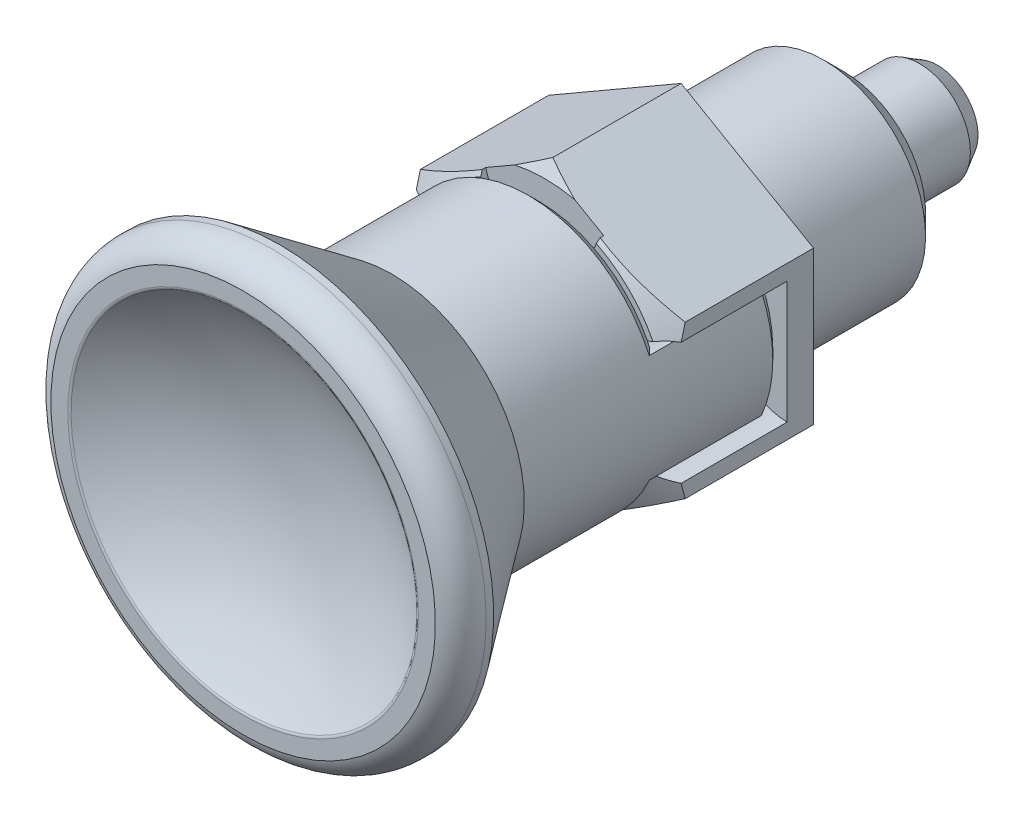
ISO-10303-21;
HEADER;
FILE_DESCRIPTION(('STEP AP214'),'2;1');
FILE_NAME('part.step','',(''),(''),'','','');
FILE_SCHEMA(('AUTOMOTIVE_DESIGN { 1 0 10303 214 1 1 1 1 }'));
ENDSEC;
DATA;
#1=APPLICATION_CONTEXT('core data for automotive mechanical design processes');
#2=APPLICATION_PROTOCOL_DEFINITION('international standard','automotive_design',2000,#1);
#3=PRODUCT_CONTEXT('',#1,'mechanical');
#4=PRODUCT('Part','Part','',(#3));
#5=PRODUCT_RELATED_PRODUCT_CATEGORY('part','',(#4));
#6=PRODUCT_DEFINITION_FORMATION('','',#4);
#7=PRODUCT_DEFINITION_CONTEXT('part definition',#1,'design');
#8=PRODUCT_DEFINITION('design','',#6,#7);
#9=PRODUCT_DEFINITION_SHAPE('','',#8);
#10=(LENGTH_UNIT() NAMED_UNIT(*) SI_UNIT(.MILLI.,.METRE.));
#11=(NAMED_UNIT(*) PLANE_ANGLE_UNIT() SI_UNIT($,.RADIAN.));
#12=(NAMED_UNIT(*) SI_UNIT($,.STERADIAN.) SOLID_ANGLE_UNIT());
#13=UNCERTAINTY_MEASURE_WITH_UNIT(LENGTH_MEASURE(1.E-05),#10,'distance_accuracy_value','');
#14=(GEOMETRIC_REPRESENTATION_CONTEXT(3) GLOBAL_UNCERTAINTY_ASSIGNED_CONTEXT((#13)) GLOBAL_UNIT_ASSIGNED_CONTEXT((#10,
#11,#12)) REPRESENTATION_CONTEXT('',''));
#15=CARTESIAN_POINT('',(0.,0.,0.));
#16=DIRECTION('',(0.,0.,1.));
#17=DIRECTION('',(1.,0.,0.));
#18=AXIS2_PLACEMENT_3D('',#15,#16,#17);
#19=CARTESIAN_POINT('',(0.,1.28703991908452E-09,32.599147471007));
#20=DIRECTION('',(0.,0.,-1.));
#21=DIRECTION('',(-1.74532925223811E-06,0.999999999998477,0.));
#22=AXIS2_PLACEMENT_3D('',#19,#20,#21);
#23=SPHERICAL_SURFACE('',#22,14.0000000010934);
#24=CARTESIAN_POINT('',(0.,-4.8919202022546E-13,21.4645927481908));
#25=DIRECTION('',(0.,0.,1.));
#26=DIRECTION('',(-1.74532925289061E-06,0.999999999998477,0.));
#27=AXIS2_PLACEMENT_3D('',#24,#25,#26);
#28=CIRCLE('',#27,8.48655944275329);
#29=CARTESIAN_POINT('',(-1.48118404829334E-05,8.48655944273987,21.464592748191));
#30=VERTEX_POINT('',#29);
#31=EDGE_CURVE('E427',#30,#30,#28,.T.);
#32=ORIENTED_EDGE('',*,*,#31,.T.);
#33=EDGE_LOOP('',(#32));
#34=FACE_BOUND('',#33,.T.);
#35=ADVANCED_FACE('F15',(#34),#23,.F.);
#36=CARTESIAN_POINT('',(-1.48118404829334E-05,8.48655944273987,21.464592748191));
#37=CARTESIAN_POINT('',(-1.49049371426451E-05,8.53989989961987,21.5066671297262));
#38=CARTESIAN_POINT('',(-1.50234382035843E-05,8.60779600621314,21.5055276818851));
#39=CARTESIAN_POINT('',(14.6991373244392,8.48658509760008,21.464592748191));
#40=CARTESIAN_POINT('',(14.7915256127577,8.53992571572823,21.5066671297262));
#41=CARTESIAN_POINT('',(14.9091250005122,8.60782202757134,21.505527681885));
#42=CARTESIAN_POINT('',(7.34958347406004,-4.24326689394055,21.4645927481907));
#43=CARTESIAN_POINT('',(7.39577771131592,-4.26993704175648,21.506667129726));
#44=CARTESIAN_POINT('',(7.45457752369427,-4.30388499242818,21.5055276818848));
#45=CARTESIAN_POINT('',(2.96236808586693E-05,-16.9731188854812,21.4645927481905));
#46=CARTESIAN_POINT('',(2.98098741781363E-05,-17.0797997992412,21.5066671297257));
#47=CARTESIAN_POINT('',(3.00468763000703E-05,-17.2155920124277,21.5055276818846));
#48=CARTESIAN_POINT('',(-7.34956866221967,-4.24329254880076,21.4645927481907));
#49=CARTESIAN_POINT('',(-7.39576280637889,-4.26996285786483,21.506667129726));
#50=CARTESIAN_POINT('',(-7.45456250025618,-4.30391101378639,21.5055276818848));
#51=CARTESIAN_POINT('',(-14.6991669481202,8.48653378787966,21.464592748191));
#52=CARTESIAN_POINT('',(-14.791555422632,8.53987408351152,21.5066671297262));
#53=CARTESIAN_POINT('',(-14.9091550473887,8.60776998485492,21.505527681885));
#54=CARTESIAN_POINT('',(-1.48118404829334E-05,8.48655944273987,21.464592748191));
#55=CARTESIAN_POINT('',(-1.49049371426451E-05,8.53989989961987,21.5066671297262));
#56=CARTESIAN_POINT('',(-1.50234382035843E-05,8.60779600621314,21.5055276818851));
#57=(BOUNDED_SURFACE() B_SPLINE_SURFACE(2,2,((#36,#37,#38),(#39,#40,#41),(#42,#43,#44),(#45,#46,
#47),(#48,#49,#50),(#51,#52,#53),(#54,#55,#56)),.UNSPECIFIED.,.T.,.F.,
.F.) B_SPLINE_SURFACE_WITH_KNOTS((3,2,2,3),(3,3),(0.,217.869655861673,435.739311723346,
653.60896758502),(0.,1.),
.UNSPECIFIED.) GEOMETRIC_REPRESENTATION_ITEM() RATIONAL_B_SPLINE_SURFACE(((1.,0.946908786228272,
1.),(0.5,0.473454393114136,0.5),(1.,0.946908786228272,1.),(0.5,0.473454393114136,0.5),(1.,
0.946908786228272,1.),(0.5,0.473454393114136,0.5),(1.,0.946908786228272,1.))) REPRESENTATION_ITEM('') SURFACE());
#58=CARTESIAN_POINT('',(0.,-4.77048955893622E-13,21.5055276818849));
#59=DIRECTION('',(0.,0.,-1.));
#60=DIRECTION('',(-1.74532925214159E-06,0.999999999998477,0.));
#61=AXIS2_PLACEMENT_3D('',#58,#59,#60);
#62=CIRCLE('',#61,8.60779600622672);
#63=CARTESIAN_POINT('',(-1.50234382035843E-05,8.60779600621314,21.5055276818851));
#64=VERTEX_POINT('',#63);
#65=EDGE_CURVE('E423',#64,#64,#62,.T.);
#66=CARTESIAN_POINT('',(-1.48118404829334E-05,8.48655944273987,21.464592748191));
#67=CARTESIAN_POINT('',(-1.48136794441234E-05,8.48761308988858,21.465423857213));
#68=CARTESIAN_POINT('',(-1.48155335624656E-05,8.48867542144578,21.4662439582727));
#69=CARTESIAN_POINT('',(-1.48192760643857E-05,8.49081971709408,21.4678637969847));
#70=CARTESIAN_POINT('',(-1.4821164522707E-05,8.49190172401,21.4686634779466));
#71=CARTESIAN_POINT('',(-1.48249748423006E-05,8.49408487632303,21.4702417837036));
#72=CARTESIAN_POINT('',(-1.48268967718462E-05,8.49518606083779,21.4710203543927));
#73=CARTESIAN_POINT('',(-1.483077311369E-05,8.49740704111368,21.4725557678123));
#74=CARTESIAN_POINT('',(-1.4832727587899E-05,8.49852687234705,21.4733125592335));
#75=CARTESIAN_POINT('',(-1.48366680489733E-05,8.50078459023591,21.4748037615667));
#76=CARTESIAN_POINT('',(-1.48386540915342E-05,8.5019225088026,21.4755381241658));
#77=CARTESIAN_POINT('',(-1.4842656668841E-05,8.50421581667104,21.4769838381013));
#78=CARTESIAN_POINT('',(-1.4844673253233E-05,8.50537123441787,21.4776951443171));
#79=CARTESIAN_POINT('',(-1.48487358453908E-05,8.50769892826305,21.4790941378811));
#80=CARTESIAN_POINT('',(-1.48507818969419E-05,8.50887122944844,21.4797817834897));
#81=CARTESIAN_POINT('',(-1.48549023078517E-05,8.51123205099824,21.4811328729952));
#82=CARTESIAN_POINT('',(-1.48569767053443E-05,8.51242059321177,21.4817962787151));
#83=CARTESIAN_POINT('',(-1.48611526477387E-05,8.51481323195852,21.4830983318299));
#84=CARTESIAN_POINT('',(-1.48632542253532E-05,8.51601734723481,21.4837369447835));
#85=CARTESIAN_POINT('',(-1.48674833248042E-05,8.51844044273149,21.4849888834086));
#86=CARTESIAN_POINT('',(-1.4869610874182E-05,8.51965943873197,21.4856021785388));
#87=CARTESIAN_POINT('',(-1.4873890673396E-05,8.52211158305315,21.4868029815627));
#88=CARTESIAN_POINT('',(-1.48760429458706E-05,8.52334474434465,21.4873904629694));
#89=CARTESIAN_POINT('',(-1.48803709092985E-05,8.52582448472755,21.4885391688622));
#90=CARTESIAN_POINT('',(-1.48825466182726E-05,8.52707107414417,21.4891003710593));
#91=CARTESIAN_POINT('',(-1.48869201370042E-05,8.52957691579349,21.4901960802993));
#92=CARTESIAN_POINT('',(-1.4889117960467E-05,8.53083617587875,21.4907305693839));
#93=CARTESIAN_POINT('',(-1.48935343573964E-05,8.53336658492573,21.4917724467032));
#94=CARTESIAN_POINT('',(-1.48957529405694E-05,8.53463773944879,21.4922798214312));
#95=CARTESIAN_POINT('',(-1.49002094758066E-05,8.53719114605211,21.4932670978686));
#96=CARTESIAN_POINT('',(-1.49024474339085E-05,8.53847340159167,21.4937469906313));
#97=CARTESIAN_POINT('',(-1.49069413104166E-05,8.54104820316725,21.4946789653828));
#98=CARTESIAN_POINT('',(-1.49091972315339E-05,8.54234075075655,21.4951310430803));
#99=CARTESIAN_POINT('',(-1.49137256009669E-05,8.5449353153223,21.4960070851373));
#100=CARTESIAN_POINT('',(-1.49159980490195E-05,8.54623733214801,21.4964310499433));
#101=CARTESIAN_POINT('',(-1.49205580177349E-05,8.54885000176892,21.4972505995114));
#102=CARTESIAN_POINT('',(-1.4922845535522E-05,8.55016065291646,21.4976461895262));
#103=CARTESIAN_POINT('',(-1.49274341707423E-05,8.55278974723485,21.4984087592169));
#104=CARTESIAN_POINT('',(-1.49297352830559E-05,8.55410818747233,21.4987757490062));
#105=CARTESIAN_POINT('',(-1.49343496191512E-05,8.55675200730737,21.4994809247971));
#106=CARTESIAN_POINT('',(-1.49366628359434E-05,8.55807738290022,21.4998191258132));
#107=CARTESIAN_POINT('',(-1.49412998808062E-05,8.5607342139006,21.5004665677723));
#108=CARTESIAN_POINT('',(-1.49436237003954E-05,8.56206566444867,21.5007758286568));
#109=CARTESIAN_POINT('',(-1.49482804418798E-05,8.56473378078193,21.5013652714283));
#110=CARTESIAN_POINT('',(-1.4950613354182E-05,8.56607044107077,21.5016454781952));
#111=CARTESIAN_POINT('',(-1.49552867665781E-05,8.56874810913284,21.5021767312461));
#112=CARTESIAN_POINT('',(-1.4957627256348E-05,8.57008911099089,21.5024278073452));
#113=CARTESIAN_POINT('',(-1.4962314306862E-05,8.57277459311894,21.5029007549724));
#114=CARTESIAN_POINT('',(-1.49646608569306E-05,8.5741190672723,21.5031226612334));
#115=CARTESIAN_POINT('',(-1.49693585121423E-05,8.57681062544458,21.5035372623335));
#116=CARTESIAN_POINT('',(-1.49717096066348E-05,8.57815770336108,21.5037299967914));
#117=CARTESIAN_POINT('',(-1.49764148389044E-05,8.58085360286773,21.5040862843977));
#118=CARTESIAN_POINT('',(-1.49787689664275E-05,8.58220241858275,21.5042498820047));
#119=CARTESIAN_POINT('',(-1.49834787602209E-05,8.58490093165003,21.5045479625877));
#120=CARTESIAN_POINT('',(-1.49858344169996E-05,8.58625062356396,21.504682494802));
#121=CARTESIAN_POINT('',(-1.49905457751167E-05,8.58895003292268,21.5049225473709));
#122=CARTESIAN_POINT('',(-1.49929014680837E-05,8.59029974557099,21.5050281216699));
#123=CARTESIAN_POINT('',(-1.49976114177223E-05,8.59299834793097,21.5052103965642));
#124=CARTESIAN_POINT('',(-1.49999656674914E-05,8.59434723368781,21.5052871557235));
#125=CARTESIAN_POINT('',(-1.50046712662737E-05,8.59704334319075,21.5054119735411));
#126=CARTESIAN_POINT('',(-1.50070226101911E-05,8.59839056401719,21.5054600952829));
#127=CARTESIAN_POINT('',(-1.50117209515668E-05,8.60108251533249,21.5055278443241));
#128=CARTESIAN_POINT('',(-1.50140679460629E-05,8.60242724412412,21.5055475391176));
#129=CARTESIAN_POINT('',(-1.50187561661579E-05,8.60511339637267,21.5055586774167));
#130=CARTESIAN_POINT('',(-1.50210973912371E-05,8.60645481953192,21.5055501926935));
#131=CARTESIAN_POINT('',(-1.50234382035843E-05,8.60779600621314,21.5055276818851));
#132=B_SPLINE_CURVE_WITH_KNOTS('',3,(#66,#67,#68,#69,#70,#71,#72,#73,#74,#75,#76,#77,#78,#79,
#80,#81,#82,#83,#84,#85,#86,#87,#88,#89,#90,#91,#92,#93,#94,#95,#96,#97,#98,#99,#100,#101,#102,
#103,#104,#105,#106,#107,#108,#109,#110,#111,#112,#113,#114,#115,#116,#117,#118,#119,#120,#121,
#122,#123,#124,#125,#126,#127,#128,#129,#130,#131),.UNSPECIFIED.,.F.,.F.,(4,2,2,2,2,2,2,2,2,2,2,
2,2,2,2,2,2,2,2,2,2,2,2,2,2,2,2,2,2,2,2,2,4),(0.,0.00402587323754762,0.00806191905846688,
0.0121074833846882,0.0161619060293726,0.0202245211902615,0.0242946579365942,0.0283716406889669,
0.0324547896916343,0.0365434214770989,0.0406368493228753,0.0447343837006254,0.0488353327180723,
0.0529390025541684,0.0570446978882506,0.0611517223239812,0.0652593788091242,0.0693669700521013,
0.0734737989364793,0.0775791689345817,0.0816823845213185,0.0857827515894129,0.0898795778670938,
0.0939721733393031,0.0980598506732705,0.10214192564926,0.106217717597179,0.110286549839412,
0.114347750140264,0.118400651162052,0.122444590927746,0.126478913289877,0.130502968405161),.UNSPECIFIED.);
#133=EDGE_CURVE('BSEAM1666',#30,#64,#132,.T.);
#134=ORIENTED_EDGE('',*,*,#31,.F.);
#135=ORIENTED_EDGE('',*,*,#65,.F.);
#136=ORIENTED_EDGE('',*,*,#133,.T.);
#137=ORIENTED_EDGE('',*,*,#133,.F.);
#138=EDGE_LOOP('',(#134,#136,#135,#137));
#139=FACE_BOUND('',#138,.T.);
#140=ADVANCED_FACE('F1666',(#139),#57,.T.);
#141=CARTESIAN_POINT('',(10.3840181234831,-10.3839818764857,21.5055276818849));
#142=DIRECTION('',(0.,0.,1.));
#143=DIRECTION('',(-1.74532925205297E-06,0.999999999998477,0.));
#144=AXIS2_PLACEMENT_3D('',#141,#142,#143);
#145=PLANE('',#144);
#146=CARTESIAN_POINT('',(0.,-4.77048955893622E-13,21.5055276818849));
#147=DIRECTION('',(0.,0.,-1.));
#148=DIRECTION('',(-1.74532925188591E-06,0.999999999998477,0.));
#149=AXIS2_PLACEMENT_3D('',#146,#147,#148);
#150=CIRCLE('',#149,9.44);
#151=CARTESIAN_POINT('',(-1.64759081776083E-05,9.43999999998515,21.5055276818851));
#152=VERTEX_POINT('',#151);
#153=EDGE_CURVE('E419',#152,#152,#150,.T.);
#154=ORIENTED_EDGE('',*,*,#153,.F.);
#155=EDGE_LOOP('',(#154));
#156=FACE_BOUND('',#155,.T.);
#157=ORIENTED_EDGE('',*,*,#65,.T.);
#158=EDGE_LOOP('',(#157));
#159=FACE_BOUND('',#158,.T.);
#160=ADVANCED_FACE('F1680',(#156,#159),#145,.T.);
#161=CARTESIAN_POINT('',(0.,-4.54497550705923E-13,20.0715123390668));
#162=DIRECTION('',(0.,0.,-1.));
#163=DIRECTION('',(0.,1.,0.));
#164=AXIS2_PLACEMENT_3D('',#161,#162,#163);
#165=TOROIDAL_SURFACE('',#164,8.99999999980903,1.50000000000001);
#166=ORIENTED_EDGE('',*,*,#153,.T.);
#167=EDGE_LOOP('',(#166));
#168=FACE_BOUND('',#167,.T.);
#169=CARTESIAN_POINT('',(0.,-4.54497550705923E-13,20.0715123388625));
#170=DIRECTION('',(0.,0.,-1.));
#171=DIRECTION('',(-1.74532925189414E-06,0.999999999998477,0.));
#172=AXIS2_PLACEMENT_3D('',#169,#170,#171);
#173=CIRCLE('',#172,10.499999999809);
#174=CARTESIAN_POINT('',(-1.83259571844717E-05,10.4999999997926,20.0715123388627));
#175=VERTEX_POINT('',#174);
#176=EDGE_CURVE('E412',#175,#175,#173,.T.);
#177=ORIENTED_EDGE('',*,*,#176,.F.);
#178=EDGE_LOOP('',(#177));
#179=FACE_BOUND('',#178,.T.);
#180=ADVANCED_FACE('F1692',(#168,#179),#165,.T.);
#181=CARTESIAN_POINT('',(0.,-4.55921975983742E-13,20.0715123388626));
#182=DIRECTION('',(0.,0.,-1.));
#183=DIRECTION('',(-1.74532925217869E-06,0.999999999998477,0.));
#184=AXIS2_PLACEMENT_3D('',#181,#182,#183);
#185=CYLINDRICAL_SURFACE('',#184,10.5);
#186=ORIENTED_EDGE('',*,*,#176,.T.);
#187=EDGE_LOOP('',(#186));
#188=FACE_BOUND('',#187,.T.);
#189=CARTESIAN_POINT('',(0.,-4.49293380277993E-13,19.7055276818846));
#190=DIRECTION('',(0.,0.,-1.));
#191=DIRECTION('',(-1.74532925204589E-06,0.999999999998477,0.));
#192=AXIS2_PLACEMENT_3D('',#189,#190,#191);
#193=CIRCLE('',#192,10.5);
#194=CARTESIAN_POINT('',(-1.83259571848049E-05,10.4999999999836,19.7055276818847));
#195=VERTEX_POINT('',#194);
#196=EDGE_CURVE('E411',#195,#195,#193,.T.);
#197=ORIENTED_EDGE('',*,*,#196,.F.);
#198=EDGE_LOOP('',(#197));
#199=FACE_BOUND('',#198,.T.);
#200=ADVANCED_FACE('F650',(#188,#199),#185,.T.);
#201=CARTESIAN_POINT('',(4.1862550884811,-2.91548139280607,1.50000000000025));
#202=DIRECTION('',(0.,0.,-1.));
#203=DIRECTION('',(-1.7453292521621E-06,0.999999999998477,0.));
#204=AXIS2_PLACEMENT_3D('',#201,#202,#203);
#205=PLANE('',#204);
#206=CARTESIAN_POINT('',(0.,-1.40946282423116E-13,1.50000000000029));
#207=DIRECTION('',(0.,0.,-1.));
#208=DIRECTION('',(0.940083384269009,0.340944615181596,0.));
#209=AXIS2_PLACEMENT_3D('',#206,#207,#208);
#210=CIRCLE('',#209,5.99999999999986);
#211=CARTESIAN_POINT('',(5.64050030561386,2.04566769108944,1.50000000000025));
#212=VERTEX_POINT('',#211);
#213=CARTESIAN_POINT('',(5.6405074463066,-2.0456480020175,1.50000000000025));
#214=VERTEX_POINT('',#213);
#215=EDGE_CURVE('E593',#212,#214,#210,.T.);
#216=ORIENTED_EDGE('',*,*,#215,.T.);
#217=CARTESIAN_POINT('',(6.44999999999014,1.12573733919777E-05,1.50000000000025));
#218=DIRECTION('',(0.,0.,-1.));
#219=DIRECTION('',(-0.367951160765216,-0.929845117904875,0.));
#220=AXIS2_PLACEMENT_3D('',#217,#218,#219);
#221=CIRCLE('',#220,2.2000000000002);
#222=EDGE_CURVE('E589',#214,#212,#221,.T.);
#223=ORIENTED_EDGE('',*,*,#222,.T.);
#224=EDGE_LOOP('',(#216,#223));
#225=FACE_BOUND('',#224,.T.);
#226=ADVANCED_FACE('F644',(#225),#205,.T.);
#227=CARTESIAN_POINT('',(-6.63749491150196,-2.91550028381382,1.5));
#228=DIRECTION('',(0.,0.,-1.));
#229=DIRECTION('',(-1.74532925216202E-06,0.999999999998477,0.));
#230=AXIS2_PLACEMENT_3D('',#227,#228,#229);
#231=PLANE('',#230);
#232=CARTESIAN_POINT('',(-6.44999999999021,-1.12573739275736E-05,1.5));
#233=DIRECTION('',(0.,0.,-1.));
#234=DIRECTION('',(0.36795116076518,0.929845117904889,0.));
#235=AXIS2_PLACEMENT_3D('',#232,#233,#234);
#236=CIRCLE('',#235,2.19999999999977);
#237=CARTESIAN_POINT('',(-5.6405074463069,2.04564800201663,1.5));
#238=VERTEX_POINT('',#237);
#239=CARTESIAN_POINT('',(-5.64050030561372,-2.04566769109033,1.5));
#240=VERTEX_POINT('',#239);
#241=EDGE_CURVE('E612',#238,#240,#236,.T.);
#242=ORIENTED_EDGE('',*,*,#241,.T.);
#243=CARTESIAN_POINT('',(0.,-1.39211558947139E-13,1.5));
#244=DIRECTION('',(0.,0.,-1.));
#245=DIRECTION('',(-0.940083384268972,-0.340944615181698,0.));
#246=AXIS2_PLACEMENT_3D('',#243,#244,#245);
#247=CIRCLE('',#246,5.99999999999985);
#248=EDGE_CURVE('E609',#240,#238,#247,.T.);
#249=ORIENTED_EDGE('',*,*,#248,.T.);
#250=EDGE_LOOP('',(#242,#249));
#251=FACE_BOUND('',#250,.T.);
#252=ADVANCED_FACE('F483',(#251),#231,.T.);
#253=CARTESIAN_POINT('',(-6.44999999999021,-1.12573739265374E-05,1.5));
#254=DIRECTION('',(0.,0.,1.));
#255=DIRECTION('',(0.190710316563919,0.981646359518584,0.));
#256=AXIS2_PLACEMENT_3D('',#253,#254,#255);
#257=CONICAL_SURFACE('',#256,2.19999999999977,0.785398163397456);
#258=CARTESIAN_POINT('',(-5.64050744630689,2.04564800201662,1.50000000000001));
#259=CARTESIAN_POINT('',(-5.65296068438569,2.0733401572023,1.52116405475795));
#260=CARTESIAN_POINT('',(-5.66571084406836,2.10085407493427,1.54238239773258));
#261=CARTESIAN_POINT('',(-5.69112690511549,2.15456487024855,1.58422017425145));
#262=CARTESIAN_POINT('',(-5.70377896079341,2.18077321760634,1.60483327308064));
#263=CARTESIAN_POINT('',(-5.72875584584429,2.23189688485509,1.64546884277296));
#264=CARTESIAN_POINT('',(-5.74107393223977,2.25682247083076,1.6654825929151));
#265=CARTESIAN_POINT('',(-5.76525989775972,2.30540017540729,1.70488273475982));
#266=CARTESIAN_POINT('',(-5.77712468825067,2.32906143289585,1.72425968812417));
#267=CARTESIAN_POINT('',(-5.7984829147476,2.3724283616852,1.76022862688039));
#268=CARTESIAN_POINT('',(-5.80804747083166,2.39214969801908,1.77675932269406));
#269=CARTESIAN_POINT('',(-5.82868764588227,2.43504390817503,1.81301494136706));
#270=CARTESIAN_POINT('',(-5.83972603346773,2.45820035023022,1.83278018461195));
#271=CARTESIAN_POINT('',(-5.86365611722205,2.50792132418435,1.87549508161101));
#272=CARTESIAN_POINT('',(-5.87657020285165,2.53445855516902,1.89846406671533));
#273=CARTESIAN_POINT('',(-5.90453232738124,2.59089014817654,1.94761602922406));
#274=CARTESIAN_POINT('',(-5.91963135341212,2.62074920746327,1.97381045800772));
#275=CARTESIAN_POINT('',(-5.93508214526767,2.65043391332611,2.00000000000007));
#276=B_SPLINE_CURVE_WITH_KNOTS('',3,(#258,#259,#260,#261,#262,#263,#264,#265,#266,#267,#268,
#269,#270,#271,#272,#273,#274,#275),.UNSPECIFIED.,.F.,.F.,(4,2,2,2,2,2,2,2,4),(0.,
0.111029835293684,0.218015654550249,0.320787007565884,0.41919524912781,0.501551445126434,
0.598703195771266,0.710893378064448,0.838371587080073),.UNSPECIFIED.);
#277=CARTESIAN_POINT('',(-5.93508214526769,2.65043391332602,2.));
#278=VERTEX_POINT('',#277);
#279=EDGE_CURVE('E431',#238,#278,#276,.T.);
#280=ORIENTED_EDGE('',*,*,#279,.T.);
#281=CARTESIAN_POINT('',(-6.44999999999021,-1.12573739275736E-05,2.));
#282=DIRECTION('',(0.,0.,1.));
#283=DIRECTION('',(0.190713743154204,-0.981645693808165,0.));
#284=AXIS2_PLACEMENT_3D('',#281,#282,#283);
#285=CIRCLE('',#284,2.69999999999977);
#286=CARTESIAN_POINT('',(-5.93507289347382,-2.6504546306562,2.));
#287=VERTEX_POINT('',#286);
#288=EDGE_CURVE('E516',#287,#278,#285,.T.);
#289=ORIENTED_EDGE('',*,*,#288,.F.);
#290=CARTESIAN_POINT('',(-5.93507289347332,-2.65045463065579,2.00000000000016));
#291=CARTESIAN_POINT('',(-5.91962413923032,-2.62077364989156,1.97381379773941));
#292=CARTESIAN_POINT('',(-5.90452698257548,-2.59091837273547,1.94762273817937));
#293=CARTESIAN_POINT('',(-5.87656716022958,-2.53449185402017,1.89847526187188));
#294=CARTESIAN_POINT('',(-5.86365355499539,-2.50795588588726,1.87550740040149));
#295=CARTESIAN_POINT('',(-5.83972321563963,-2.45823490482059,1.83279254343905));
#296=CARTESIAN_POINT('',(-5.82868410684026,-2.43507717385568,1.81302623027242));
#297=CARTESIAN_POINT('',(-5.80804199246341,-2.39217775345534,1.77676607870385));
#298=CARTESIAN_POINT('',(-5.79847608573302,-2.37245250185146,1.76023198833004));
#299=CARTESIAN_POINT('',(-5.77711924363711,-2.32908591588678,1.72426311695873));
#300=CARTESIAN_POINT('',(-5.76525735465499,-2.3054289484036,1.70488948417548));
#301=CARTESIAN_POINT('',(-5.74107488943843,-2.25685702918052,1.66549380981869));
#302=CARTESIAN_POINT('',(-5.72875737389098,-2.23193291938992,1.64548124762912));
#303=CARTESIAN_POINT('',(-5.70378007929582,-2.18080928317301,1.6048457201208));
#304=CARTESIAN_POINT('',(-5.69112705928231,-2.15459946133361,1.58423150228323));
#305=CARTESIAN_POINT('',(-5.66570781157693,-2.10088276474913,1.54238920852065));
#306=CARTESIAN_POINT('',(-5.65295547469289,-2.07336438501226,1.52116748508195));
#307=CARTESIAN_POINT('',(-5.6405003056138,-2.04566769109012,1.50000000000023));
#308=B_SPLINE_CURVE_WITH_KNOTS('',3,(#290,#291,#292,#293,#294,#295,#296,#297,#298,#299,#300,
#301,#302,#303,#304,#305,#306,#307),.UNSPECIFIED.,.F.,.F.,(4,2,2,2,2,2,2,2,4),(0.,
0.127462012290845,0.239646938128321,0.336804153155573,0.419176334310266,0.517566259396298,
0.620331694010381,0.727323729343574,0.838371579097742),.UNSPECIFIED.);
#309=EDGE_CURVE('E504',#287,#240,#308,.T.);
#310=ORIENTED_EDGE('',*,*,#309,.T.);
#311=ORIENTED_EDGE('',*,*,#241,.F.);
#312=EDGE_LOOP('',(#280,#289,#310,#311));
#313=FACE_BOUND('',#312,.T.);
#314=ADVANCED_FACE('F472',(#313),#257,.T.);
#315=CARTESIAN_POINT('',(6.44999999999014,1.12573733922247E-05,1.50000000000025));
#316=DIRECTION('',(0.,0.,1.));
#317=DIRECTION('',(-0.190710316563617,-0.981646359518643,0.));
#318=AXIS2_PLACEMENT_3D('',#315,#316,#317);
#319=CONICAL_SURFACE('',#318,2.20000000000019,0.785398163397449);
#320=CARTESIAN_POINT('',(5.93508214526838,-2.65043391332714,2.00000000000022));
#321=CARTESIAN_POINT('',(5.92629674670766,-2.63336023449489,1.98501517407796));
#322=CARTESIAN_POINT('',(5.91767324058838,-2.61611095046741,1.97014168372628));
#323=CARTESIAN_POINT('',(5.8981191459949,-2.57635211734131,1.93623705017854));
#324=CARTESIAN_POINT('',(5.88724705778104,-2.5537718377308,1.91725489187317));
#325=CARTESIAN_POINT('',(5.86304096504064,-2.50349739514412,1.87513448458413));
#326=CARTESIAN_POINT('',(5.8497004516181,-2.47578955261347,1.85201671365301));
#327=CARTESIAN_POINT('',(5.82038164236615,-2.41542997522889,1.80163220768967));
#328=CARTESIAN_POINT('',(5.80436324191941,-2.38279179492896,1.77437242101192));
#329=CARTESIAN_POINT('',(5.77370930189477,-2.32086473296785,1.72267295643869));
#330=CARTESIAN_POINT('',(5.75909726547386,-2.291570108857,1.69822618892));
#331=CARTESIAN_POINT('',(5.73135458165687,-2.23563555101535,1.65191833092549));
#332=CARTESIAN_POINT('',(5.71821826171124,-2.20901494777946,1.63003730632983));
#333=CARTESIAN_POINT('',(5.6934792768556,-2.15837071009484,1.58883719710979));
#334=CARTESIAN_POINT('',(5.68186272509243,-2.13437353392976,1.56949419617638));
#335=CARTESIAN_POINT('',(5.66029373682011,-2.08884415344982,1.53340110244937));
#336=CARTESIAN_POINT('',(5.65030710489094,-2.06735646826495,1.51661514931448));
#337=CARTESIAN_POINT('',(5.64050744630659,-2.04564800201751,1.50000000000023));
#338=B_SPLINE_CURVE_WITH_KNOTS('',3,(#320,#321,#322,#323,#324,#325,#326,#327,#328,#329,#330,
#331,#332,#333,#334,#335,#336,#337),.UNSPECIFIED.,.F.,.F.,(4,2,2,2,2,2,2,2,4),(0.,
0.0730625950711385,0.167376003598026,0.282793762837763,0.419117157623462,0.541688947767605,
0.652322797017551,0.751134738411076,0.838248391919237),.UNSPECIFIED.);
#339=CARTESIAN_POINT('',(5.93508214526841,-2.65043391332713,2.00000000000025));
#340=VERTEX_POINT('',#339);
#341=EDGE_CURVE('E558',#340,#214,#338,.T.);
#342=ORIENTED_EDGE('',*,*,#341,.F.);
#343=CARTESIAN_POINT('',(6.44999999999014,1.12573733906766E-05,2.00000000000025));
#344=DIRECTION('',(0.,0.,1.));
#345=DIRECTION('',(-0.190713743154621,0.981645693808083,0.));
#346=AXIS2_PLACEMENT_3D('',#343,#344,#345);
#347=CIRCLE('',#346,2.70000000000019);
#348=CARTESIAN_POINT('',(5.93507289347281,2.65045463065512,2.00000000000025));
#349=VERTEX_POINT('',#348);
#350=EDGE_CURVE('E568',#349,#340,#347,.T.);
#351=ORIENTED_EDGE('',*,*,#350,.F.);
#352=CARTESIAN_POINT('',(5.64050030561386,2.04566769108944,1.50000000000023));
#353=CARTESIAN_POINT('',(5.65029917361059,2.06737455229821,1.51661391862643));
#354=CARTESIAN_POINT('',(5.66028502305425,2.08886063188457,1.53339863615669));
#355=CARTESIAN_POINT('',(5.68185293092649,2.13438788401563,1.56949007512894));
#356=CARTESIAN_POINT('',(5.69346919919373,2.15838452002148,1.58883267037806));
#357=CARTESIAN_POINT('',(5.71820806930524,2.20902879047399,1.63003278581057));
#358=CARTESIAN_POINT('',(5.73134455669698,2.23564996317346,1.65191422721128));
#359=CARTESIAN_POINT('',(5.75908797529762,2.29158682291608,1.69822373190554));
#360=CARTESIAN_POINT('',(5.77370056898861,2.32088318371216,1.72267173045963));
#361=CARTESIAN_POINT('',(5.80435485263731,2.38281238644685,1.77437247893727));
#362=CARTESIAN_POINT('',(5.82037304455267,2.41545097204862,1.8016323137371));
#363=CARTESIAN_POINT('',(5.84969153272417,2.4758110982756,1.8520168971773));
#364=CARTESIAN_POINT('',(5.86303191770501,2.50351910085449,1.87513468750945));
#365=CARTESIAN_POINT('',(5.88723782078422,2.55379363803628,1.91725509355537));
#366=CARTESIAN_POINT('',(5.89810983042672,2.57637386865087,1.93623722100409));
#367=CARTESIAN_POINT('',(5.91766389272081,2.61613232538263,1.97014177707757));
#368=CARTESIAN_POINT('',(5.92628740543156,2.6333813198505,1.98501520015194));
#369=CARTESIAN_POINT('',(5.93507289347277,2.65045463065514,2.00000000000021));
#370=B_SPLINE_CURVE_WITH_KNOTS('',3,(#352,#353,#354,#355,#356,#357,#358,#359,#360,#361,#362,
#363,#364,#365,#366,#367,#368,#369),.UNSPECIFIED.,.F.,.F.,(4,2,2,2,2,2,2,2,4),(0.,
0.0871071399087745,0.185916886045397,0.296552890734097,0.419131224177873,0.555455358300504,
0.670873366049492,0.765186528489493,0.838248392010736),.UNSPECIFIED.);
#371=EDGE_CURVE('E523',#212,#349,#370,.T.);
#372=ORIENTED_EDGE('',*,*,#371,.F.);
#373=ORIENTED_EDGE('',*,*,#222,.F.);
#374=EDGE_LOOP('',(#342,#351,#372,#373));
#375=FACE_BOUND('',#374,.T.);
#376=ADVANCED_FACE('F482',(#375),#319,.T.);
#377=CARTESIAN_POINT('',(0.,-3.47311272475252E-13,14.2));
#378=DIRECTION('',(0.,0.,1.));
#379=DIRECTION('',(-1.74532925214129E-06,0.999999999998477,0.));
#380=AXIS2_PLACEMENT_3D('',#377,#378,#379);
#381=CONICAL_SURFACE('',#380,6.50000000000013,0.628318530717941);
#382=ORIENTED_EDGE('',*,*,#196,.T.);
#383=EDGE_LOOP('',(#382));
#384=FACE_BOUND('',#383,.T.);
#385=CARTESIAN_POINT('',(0.,-3.60822483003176E-13,14.2));
#386=DIRECTION('',(0.,0.,1.));
#387=DIRECTION('',(-1.74532925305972E-06,0.999999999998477,0.));
#388=AXIS2_PLACEMENT_3D('',#385,#386,#387);
#389=CIRCLE('',#388,6.50000000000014);
#390=CARTESIAN_POINT('',(-1.13446401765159E-05,6.49999999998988,14.2000000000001));
#391=VERTEX_POINT('',#390);
#392=EDGE_CURVE('E404',#391,#391,#389,.T.);
#393=ORIENTED_EDGE('',*,*,#392,.T.);
#394=EDGE_LOOP('',(#393));
#395=FACE_BOUND('',#394,.T.);
#396=ADVANCED_FACE('F537',(#384,#395),#381,.T.);
#397=CARTESIAN_POINT('',(0.,-1.39833253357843E-13,1.50000000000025));
#398=DIRECTION('',(0.,0.,1.));
#399=DIRECTION('',(0.913088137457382,0.407762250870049,0.));
#400=AXIS2_PLACEMENT_3D('',#397,#398,#399);
#401=CONICAL_SURFACE('',#400,5.99999999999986,0.785398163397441);
#402=ORIENTED_EDGE('',*,*,#371,.T.);
#403=CARTESIAN_POINT('',(0.,-1.42247325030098E-13,2.00000000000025));
#404=DIRECTION('',(0.,0.,1.));
#405=DIRECTION('',(0.913089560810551,-0.407759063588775,0.));
#406=AXIS2_PLACEMENT_3D('',#403,#404,#405);
#407=CIRCLE('',#406,6.49999999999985);
#408=EDGE_CURVE('E395',#340,#349,#407,.T.);
#409=ORIENTED_EDGE('',*,*,#408,.F.);
#410=ORIENTED_EDGE('',*,*,#341,.T.);
#411=ORIENTED_EDGE('',*,*,#215,.F.);
#412=EDGE_LOOP('',(#402,#409,#410,#411));
#413=FACE_BOUND('',#412,.T.);
#414=ADVANCED_FACE('F528',(#413),#401,.T.);
#415=CARTESIAN_POINT('',(0.,-1.38385226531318E-13,1.5));
#416=DIRECTION('',(0.,0.,1.));
#417=DIRECTION('',(-0.913088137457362,-0.407762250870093,0.));
#418=AXIS2_PLACEMENT_3D('',#415,#416,#417);
#419=CONICAL_SURFACE('',#418,5.99999999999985,0.785398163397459);
#420=ORIENTED_EDGE('',*,*,#309,.F.);
#421=CARTESIAN_POINT('',(0.,-1.32272665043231E-13,2.));
#422=DIRECTION('',(0.,0.,1.));
#423=DIRECTION('',(-0.913089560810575,0.407759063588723,0.));
#424=AXIS2_PLACEMENT_3D('',#421,#422,#423);
#425=CIRCLE('',#424,6.49999999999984);
#426=EDGE_CURVE('E394',#278,#287,#425,.T.);
#427=ORIENTED_EDGE('',*,*,#426,.F.);
#428=ORIENTED_EDGE('',*,*,#279,.F.);
#429=ORIENTED_EDGE('',*,*,#248,.F.);
#430=EDGE_LOOP('',(#420,#427,#428,#429));
#431=FACE_BOUND('',#430,.T.);
#432=ADVANCED_FACE('F484',(#431),#419,.T.);
#433=CARTESIAN_POINT('',(-6.44999999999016,-1.12573735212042E-05,7.82499999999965));
#434=DIRECTION('',(0.,-1.99256500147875E-13,-1.));
#435=DIRECTION('',(0.0552038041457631,0.998475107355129,-1.99786810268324E-13));
#436=AXIS2_PLACEMENT_3D('',#433,#434,#435);
#437=CYLINDRICAL_SURFACE('',#436,2.7);
#438=CARTESIAN_POINT('',(-5.93508214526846,2.65043391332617,7.5));
#439=CARTESIAN_POINT('',(-5.76853104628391,2.61807703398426,7.33473011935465));
#440=CARTESIAN_POINT('',(-5.60631605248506,2.57026104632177,7.16740993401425));
#441=CARTESIAN_POINT('',(-5.45058577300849,2.50820946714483,7.));
#442=B_SPLINE_CURVE_WITH_KNOTS('',3,(#438,#439,#440,#441),.UNSPECIFIED.,.F.,.F.,(4,4),(0.,
0.000710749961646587),.UNSPECIFIED.);
#443=CARTESIAN_POINT('',(-5.93508214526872,2.65043391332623,7.5));
#444=VERTEX_POINT('',#443);
#445=CARTESIAN_POINT('',(-5.4505857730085,2.50820946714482,7.));
#446=VERTEX_POINT('',#445);
#447=EDGE_CURVE('E363',#444,#446,#442,.T.);
#448=ORIENTED_EDGE('',*,*,#447,.T.);
#449=CARTESIAN_POINT('',(-6.44999999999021,-1.12573741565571E-05,7.));
#450=DIRECTION('',(0.,0.,-1.));
#451=DIRECTION('',(0.370153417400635,0.928970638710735,0.));
#452=AXIS2_PLACEMENT_3D('',#449,#450,#451);
#453=CIRCLE('',#452,2.7);
#454=CARTESIAN_POINT('',(-5.45057701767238,-2.50822849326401,7.));
#455=VERTEX_POINT('',#454);
#456=EDGE_CURVE('E359',#446,#455,#453,.T.);
#457=ORIENTED_EDGE('',*,*,#456,.T.);
#458=CARTESIAN_POINT('',(-5.45057701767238,-2.50822849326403,7.));
#459=CARTESIAN_POINT('',(-5.60630708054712,-2.57028061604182,7.16740993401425));
#460=CARTESIAN_POINT('',(-5.7685219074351,-2.61809716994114,7.33473011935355));
#461=CARTESIAN_POINT('',(-5.93507289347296,-2.65045463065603,7.5));
#462=B_SPLINE_CURVE_WITH_KNOTS('',3,(#458,#459,#460,#461),.UNSPECIFIED.,.F.,.F.,(4,4),(0.,
0.00071074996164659),.UNSPECIFIED.);
#463=CARTESIAN_POINT('',(-5.93507289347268,-2.65045463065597,7.5));
#464=VERTEX_POINT('',#463);
#465=EDGE_CURVE('E364',#455,#464,#462,.T.);
#466=ORIENTED_EDGE('',*,*,#465,.T.);
#467=DIRECTION('',(0.,0.,-1.));
#468=VECTOR('',#467,1.);
#469=CARTESIAN_POINT('',(-5.93507289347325,-2.65045463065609,7.5));
#470=LINE('',#469,#468);
#471=EDGE_CURVE('E378',#464,#287,#470,.T.);
#472=ORIENTED_EDGE('',*,*,#471,.T.);
#473=ORIENTED_EDGE('',*,*,#288,.T.);
#474=DIRECTION('',(0.,0.,1.));
#475=VECTOR('',#474,1.);
#476=CARTESIAN_POINT('',(-5.93508214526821,2.65043391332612,2.));
#477=LINE('',#476,#475);
#478=EDGE_CURVE('E402',#278,#444,#477,.T.);
#479=ORIENTED_EDGE('',*,*,#478,.T.);
#480=EDGE_LOOP('',(#448,#457,#466,#472,#473,#479));
#481=FACE_BOUND('',#480,.T.);
#482=ADVANCED_FACE('F640',(#481),#437,.T.);
#483=CARTESIAN_POINT('',(6.44999999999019,1.12573735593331E-05,7.82500000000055));
#484=DIRECTION('',(0.,-1.16685229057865E-13,-1.));
#485=DIRECTION('',(-0.0618326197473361,-0.998086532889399,1.17238139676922E-13));
#486=AXIS2_PLACEMENT_3D('',#483,#484,#485);
#487=CYLINDRICAL_SURFACE('',#486,2.7);
#488=CARTESIAN_POINT('',(5.4505770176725,2.50822849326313,7.));
#489=CARTESIAN_POINT('',(5.60630708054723,2.5702806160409,7.16740993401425));
#490=CARTESIAN_POINT('',(5.76852190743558,2.61809716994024,7.3347301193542));
#491=CARTESIAN_POINT('',(5.93507289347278,2.65045463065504,7.5));
#492=B_SPLINE_CURVE_WITH_KNOTS('',3,(#488,#489,#490,#491),.UNSPECIFIED.,.F.,.F.,(4,4),(0.,
0.00071074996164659),.UNSPECIFIED.);
#493=CARTESIAN_POINT('',(5.45057701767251,2.50822849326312,7.));
#494=VERTEX_POINT('',#493);
#495=CARTESIAN_POINT('',(5.93507289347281,2.65045463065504,7.5));
#496=VERTEX_POINT('',#495);
#497=EDGE_CURVE('E396',#494,#496,#492,.T.);
#498=ORIENTED_EDGE('',*,*,#497,.T.);
#499=DIRECTION('',(0.,0.,-1.));
#500=VECTOR('',#499,1.);
#501=CARTESIAN_POINT('',(5.93507289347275,2.65045463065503,7.5));
#502=LINE('',#501,#500);
#503=EDGE_CURVE('E403',#496,#349,#502,.T.);
#504=ORIENTED_EDGE('',*,*,#503,.T.);
#505=ORIENTED_EDGE('',*,*,#350,.T.);
#506=DIRECTION('',(0.,0.,1.));
#507=VECTOR('',#506,1.);
#508=CARTESIAN_POINT('',(5.93508214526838,-2.65043391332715,2.00000000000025));
#509=LINE('',#508,#507);
#510=CARTESIAN_POINT('',(5.93508214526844,-2.65043391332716,7.5));
#511=VERTEX_POINT('',#510);
#512=EDGE_CURVE('E387',#340,#511,#509,.T.);
#513=ORIENTED_EDGE('',*,*,#512,.T.);
#514=CARTESIAN_POINT('',(5.93508214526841,-2.65043391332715,7.5));
#515=CARTESIAN_POINT('',(5.76853104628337,-2.61807703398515,7.3347301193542));
#516=CARTESIAN_POINT('',(5.60631605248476,-2.57026104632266,7.16740993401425));
#517=CARTESIAN_POINT('',(5.45058577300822,-2.50820946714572,7.));
#518=B_SPLINE_CURVE_WITH_KNOTS('',3,(#514,#515,#516,#517),.UNSPECIFIED.,.F.,.F.,(4,4),(0.,
0.00071074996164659),.UNSPECIFIED.);
#519=CARTESIAN_POINT('',(5.45058577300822,-2.50820946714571,7.));
#520=VERTEX_POINT('',#519);
#521=EDGE_CURVE('E350',#511,#520,#518,.T.);
#522=ORIENTED_EDGE('',*,*,#521,.T.);
#523=CARTESIAN_POINT('',(6.44999999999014,1.12573731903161E-05,7.00000000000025));
#524=DIRECTION('',(0.,0.,-1.));
#525=DIRECTION('',(-0.370153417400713,-0.928970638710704,0.));
#526=AXIS2_PLACEMENT_3D('',#523,#524,#525);
#527=CIRCLE('',#526,2.7);
#528=EDGE_CURVE('E346',#520,#494,#527,.T.);
#529=ORIENTED_EDGE('',*,*,#528,.T.);
#530=EDGE_LOOP('',(#498,#504,#505,#513,#522,#529));
#531=FACE_BOUND('',#530,.T.);
#532=ADVANCED_FACE('F1765',(#531),#487,.T.);
#533=CARTESIAN_POINT('',(0.,-3.50514701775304E-13,14.3));
#534=DIRECTION('',(0.,0.,-1.));
#535=DIRECTION('',(-1.74532925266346E-06,0.999999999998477,0.));
#536=AXIS2_PLACEMENT_3D('',#533,#534,#535);
#537=CYLINDRICAL_SURFACE('',#536,6.49999999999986);
#538=ORIENTED_EDGE('',*,*,#503,.F.);
#539=CARTESIAN_POINT('',(0.,-2.30718222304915E-13,7.5));
#540=DIRECTION('',(0.,0.,1.));
#541=DIRECTION('',(-1.74532925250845E-06,0.999999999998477,0.));
#542=AXIS2_PLACEMENT_3D('',#539,#540,#541);
#543=CIRCLE('',#542,6.49999999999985);
#544=EDGE_CURVE('E351',#496,#444,#543,.T.);
#545=ORIENTED_EDGE('',*,*,#544,.T.);
#546=ORIENTED_EDGE('',*,*,#478,.F.);
#547=ORIENTED_EDGE('',*,*,#426,.T.);
#548=ORIENTED_EDGE('',*,*,#471,.F.);
#549=CARTESIAN_POINT('',(0.,-2.2811613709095E-13,7.5));
#550=DIRECTION('',(0.,0.,1.));
#551=DIRECTION('',(-0.913088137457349,-0.407762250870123,0.));
#552=AXIS2_PLACEMENT_3D('',#549,#550,#551);
#553=CIRCLE('',#552,6.49999999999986);
#554=EDGE_CURVE('E388',#464,#511,#553,.T.);
#555=ORIENTED_EDGE('',*,*,#554,.T.);
#556=ORIENTED_EDGE('',*,*,#512,.F.);
#557=ORIENTED_EDGE('',*,*,#408,.T.);
#558=EDGE_LOOP('',(#538,#545,#546,#547,#548,#555,#556,#557));
#559=FACE_BOUND('',#558,.T.);
#560=ORIENTED_EDGE('',*,*,#392,.F.);
#561=EDGE_LOOP('',(#560));
#562=FACE_BOUND('',#561,.T.);
#563=ADVANCED_FACE('F958',(#559,#562),#537,.T.);
#564=CARTESIAN_POINT('',(0.,-2.3189592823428E-13,7.));
#565=DIRECTION('',(0.,0.,1.));
#566=DIRECTION('',(0.913089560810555,-0.407759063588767,0.));
#567=AXIS2_PLACEMENT_3D('',#564,#565,#566);
#568=CONICAL_SURFACE('',#567,5.99999999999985,0.785398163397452);
#569=ORIENTED_EDGE('',*,*,#521,.F.);
#570=ORIENTED_EDGE('',*,*,#554,.F.);
#571=ORIENTED_EDGE('',*,*,#465,.F.);
#572=CARTESIAN_POINT('',(0.,-2.34621350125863E-13,7.));
#573=DIRECTION('',(0.,0.,-1.));
#574=DIRECTION('',(0.908430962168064,-0.418034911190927,0.));
#575=AXIS2_PLACEMENT_3D('',#572,#573,#574);
#576=CIRCLE('',#575,5.99999999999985);
#577=CARTESIAN_POINT('',(-5.34545454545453,-2.72509003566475,7.));
#578=VERTEX_POINT('',#577);
#579=EDGE_CURVE('E358',#578,#455,#576,.T.);
#580=ORIENTED_EDGE('',*,*,#579,.F.);
#581=CARTESIAN_POINT('',(-2.72509003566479,-5.34545454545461,7.));
#582=VERTEX_POINT('',#581);
#583=EDGE_CURVE('E908',#582,#578,#576,.T.);
#584=ORIENTED_EDGE('',*,*,#583,.F.);
#585=CARTESIAN_POINT('',(2.72509003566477,-5.34545454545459,7.));
#586=VERTEX_POINT('',#585);
#587=EDGE_CURVE('E915',#586,#582,#576,.T.);
#588=ORIENTED_EDGE('',*,*,#587,.F.);
#589=CARTESIAN_POINT('',(5.34545454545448,-2.72509003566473,7.));
#590=VERTEX_POINT('',#589);
#591=EDGE_CURVE('E357',#590,#586,#576,.T.);
#592=ORIENTED_EDGE('',*,*,#591,.F.);
#593=EDGE_CURVE('E352',#520,#590,#576,.T.);
#594=ORIENTED_EDGE('',*,*,#593,.F.);
#595=EDGE_LOOP('',(#569,#570,#571,#580,#584,#588,#592,#594));
#596=FACE_BOUND('',#595,.T.);
#597=ADVANCED_FACE('F906',(#596),#568,.T.);
#598=CARTESIAN_POINT('',(-7.14998752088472,-7.15001247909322,7.));
#599=DIRECTION('',(0.,0.,-1.));
#600=DIRECTION('',(-1.74532925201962E-06,0.999999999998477,0.));
#601=AXIS2_PLACEMENT_3D('',#598,#599,#600);
#602=PLANE('',#601);
#603=ORIENTED_EDGE('',*,*,#587,.T.);
#604=CARTESIAN_POINT('',(0.,-6.6,7.));
#605=DIRECTION('',(0.,0.,-1.));
#606=DIRECTION('',(-0.944959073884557,0.327188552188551,0.));
#607=AXIS2_PLACEMENT_3D('',#604,#605,#606);
#608=CIRCLE('',#607,3.);
#609=EDGE_CURVE('E933',#582,#586,#608,.T.);
#610=ORIENTED_EDGE('',*,*,#609,.T.);
#611=EDGE_LOOP('',(#603,#610));
#612=FACE_BOUND('',#611,.T.);
#613=ADVANCED_FACE('F1796',(#612),#602,.T.);
#614=CARTESIAN_POINT('',(0.,-2.30492873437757E-13,7.));
#615=DIRECTION('',(0.,0.,1.));
#616=DIRECTION('',(-0.913089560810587,0.407759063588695,0.));
#617=AXIS2_PLACEMENT_3D('',#614,#615,#616);
#618=CONICAL_SURFACE('',#617,5.99999999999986,0.785398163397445);
#619=ORIENTED_EDGE('',*,*,#447,.F.);
#620=ORIENTED_EDGE('',*,*,#544,.F.);
#621=ORIENTED_EDGE('',*,*,#497,.F.);
#622=CARTESIAN_POINT('',(0.,-2.32452945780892E-13,7.));
#623=DIRECTION('',(0.,0.,-1.));
#624=DIRECTION('',(-1.7453292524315E-06,0.999999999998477,0.));
#625=AXIS2_PLACEMENT_3D('',#622,#623,#624);
#626=CIRCLE('',#625,5.99999999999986);
#627=CARTESIAN_POINT('',(5.34545454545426,2.72509003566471,7.));
#628=VERTEX_POINT('',#627);
#629=EDGE_CURVE('E356',#628,#494,#626,.T.);
#630=ORIENTED_EDGE('',*,*,#629,.F.);
#631=CARTESIAN_POINT('',(2.7250900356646,5.34545454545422,7.));
#632=VERTEX_POINT('',#631);
#633=EDGE_CURVE('E439',#632,#628,#626,.T.);
#634=ORIENTED_EDGE('',*,*,#633,.F.);
#635=CARTESIAN_POINT('',(-2.72509003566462,5.34545454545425,7.));
#636=VERTEX_POINT('',#635);
#637=EDGE_CURVE('E31',#636,#632,#626,.T.);
#638=ORIENTED_EDGE('',*,*,#637,.F.);
#639=CARTESIAN_POINT('',(0.,-2.33320307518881E-13,7.));
#640=DIRECTION('',(0.,0.,-1.));
#641=DIRECTION('',(-0.908430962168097,0.418034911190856,0.));
#642=AXIS2_PLACEMENT_3D('',#639,#640,#641);
#643=CIRCLE('',#642,5.99999999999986);
#644=CARTESIAN_POINT('',(-5.34545454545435,2.72509003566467,7.));
#645=VERTEX_POINT('',#644);
#646=EDGE_CURVE('E438',#645,#636,#643,.T.);
#647=ORIENTED_EDGE('',*,*,#646,.F.);
#648=EDGE_CURVE('E442',#446,#645,#643,.T.);
#649=ORIENTED_EDGE('',*,*,#648,.F.);
#650=EDGE_LOOP('',(#619,#620,#621,#630,#634,#638,#647,#649));
#651=FACE_BOUND('',#650,.T.);
#652=ADVANCED_FACE('F954',(#651),#618,.T.);
#653=ORIENTED_EDGE('',*,*,#648,.T.);
#654=CARTESIAN_POINT('',(-6.6,0.,7.));
#655=DIRECTION('',(0.,0.,-1.));
#656=DIRECTION('',(1.,0.,0.));
#657=AXIS2_PLACEMENT_3D('',#654,#655,#656);
#658=CIRCLE('',#657,3.);
#659=EDGE_CURVE('E39',#645,#578,#658,.T.);
#660=ORIENTED_EDGE('',*,*,#659,.T.);
#661=ORIENTED_EDGE('',*,*,#579,.T.);
#662=ORIENTED_EDGE('',*,*,#456,.F.);
#663=EDGE_LOOP('',(#653,#660,#661,#662));
#664=FACE_BOUND('',#663,.T.);
#665=ADVANCED_FACE('F952',(#664),#602,.T.);
#666=ORIENTED_EDGE('',*,*,#637,.T.);
#667=CARTESIAN_POINT('',(0.,6.6,7.));
#668=DIRECTION('',(0.,0.,-1.));
#669=DIRECTION('',(0.944959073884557,-0.327188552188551,0.));
#670=AXIS2_PLACEMENT_3D('',#667,#668,#669);
#671=CIRCLE('',#670,3.);
#672=EDGE_CURVE('E798',#632,#636,#671,.T.);
#673=ORIENTED_EDGE('',*,*,#672,.T.);
#674=EDGE_LOOP('',(#666,#673));
#675=FACE_BOUND('',#674,.T.);
#676=ADVANCED_FACE('F1823',(#675),#602,.T.);
#677=ORIENTED_EDGE('',*,*,#593,.T.);
#678=CARTESIAN_POINT('',(6.6,0.,7.));
#679=DIRECTION('',(0.,0.,-1.));
#680=DIRECTION('',(-0.327188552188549,-0.944959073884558,0.));
#681=AXIS2_PLACEMENT_3D('',#678,#679,#680);
#682=CIRCLE('',#681,3.00000000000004);
#683=EDGE_CURVE('E2080',#590,#628,#682,.T.);
#684=ORIENTED_EDGE('',*,*,#683,.T.);
#685=ORIENTED_EDGE('',*,*,#629,.T.);
#686=ORIENTED_EDGE('',*,*,#528,.F.);
#687=EDGE_LOOP('',(#677,#684,#685,#686));
#688=FACE_BOUND('',#687,.T.);
#689=ADVANCED_FACE('F688',(#688),#602,.T.);
#690=CARTESIAN_POINT('',(0.,0.,-8.));
#691=DIRECTION('',(0.,0.,-1.));
#692=DIRECTION('',(0.,1.,0.));
#693=AXIS2_PLACEMENT_3D('',#690,#691,#692);
#694=SPHERICAL_SURFACE('',#693,5.);
#695=CARTESIAN_POINT('',(0.,0.,-12.588122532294));
#696=DIRECTION('',(0.,0.,1.));
#697=DIRECTION('',(0.,1.,0.));
#698=AXIS2_PLACEMENT_3D('',#695,#696,#697);
#699=CIRCLE('',#698,1.9872422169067);
#700=CARTESIAN_POINT('',(0.,1.9872422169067,-12.588122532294));
#701=VERTEX_POINT('',#700);
#702=EDGE_CURVE('E1649',#701,#701,#699,.T.);
#703=ORIENTED_EDGE('',*,*,#702,.F.);
#704=EDGE_LOOP('',(#703));
#705=FACE_BOUND('',#704,.T.);
#706=ADVANCED_FACE('F1037',(#705),#694,.T.);
#707=CARTESIAN_POINT('',(0.,0.,-12.588122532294));
#708=DIRECTION('',(0.,0.,1.));
#709=DIRECTION('',(0.,1.,0.));
#710=AXIS2_PLACEMENT_3D('',#707,#708,#709);
#711=CONICAL_SURFACE('',#710,1.9872422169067,0.523598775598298);
#712=CARTESIAN_POINT('',(0.,0.,-11.7));
#713=DIRECTION('',(0.,0.,1.));
#714=DIRECTION('',(0.,1.,0.));
#715=AXIS2_PLACEMENT_3D('',#712,#713,#714);
#716=CIRCLE('',#715,2.5);
#717=CARTESIAN_POINT('',(0.,2.5,-11.7));
#718=VERTEX_POINT('',#717);
#719=EDGE_CURVE('E1641',#718,#718,#716,.T.);
#720=ORIENTED_EDGE('',*,*,#719,.F.);
#721=EDGE_LOOP('',(#720));
#722=FACE_BOUND('',#721,.T.);
#723=ORIENTED_EDGE('',*,*,#702,.T.);
#724=EDGE_LOOP('',(#723));
#725=FACE_BOUND('',#724,.T.);
#726=ADVANCED_FACE('F1042',(#722,#725),#711,.T.);
#727=CARTESIAN_POINT('',(0.,0.,-8.5));
#728=DIRECTION('',(0.,0.,-1.));
#729=DIRECTION('',(0.,1.,0.));
#730=AXIS2_PLACEMENT_3D('',#727,#728,#729);
#731=CYLINDRICAL_SURFACE('',#730,2.5);
#732=CARTESIAN_POINT('',(0.,0.,-8.5));
#733=DIRECTION('',(0.,0.,1.));
#734=DIRECTION('',(0.,1.,0.));
#735=AXIS2_PLACEMENT_3D('',#732,#733,#734);
#736=CIRCLE('',#735,2.5);
#737=CARTESIAN_POINT('',(0.,2.5,-8.5));
#738=VERTEX_POINT('',#737);
#739=EDGE_CURVE('E1633',#738,#738,#736,.T.);
#740=ORIENTED_EDGE('',*,*,#739,.F.);
#741=EDGE_LOOP('',(#740));
#742=FACE_BOUND('',#741,.T.);
#743=ORIENTED_EDGE('',*,*,#719,.T.);
#744=EDGE_LOOP('',(#743));
#745=FACE_BOUND('',#744,.T.);
#746=ADVANCED_FACE('F1053',(#742,#745),#731,.T.);
#747=CARTESIAN_POINT('',(0.,0.,-8.37320508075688));
#748=DIRECTION('',(0.,0.,-1.));
#749=DIRECTION('',(0.,1.,0.));
#750=AXIS2_PLACEMENT_3D('',#747,#748,#749);
#751=CONICAL_SURFACE('',#750,2.42679491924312,0.523598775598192);
#752=CARTESIAN_POINT('',(0.,0.,-8.37320508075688));
#753=DIRECTION('',(0.,0.,1.));
#754=DIRECTION('',(0.,1.,0.));
#755=AXIS2_PLACEMENT_3D('',#752,#753,#754);
#756=CIRCLE('',#755,2.42679491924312);
#757=CARTESIAN_POINT('',(0.,2.42679491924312,-8.37320508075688));
#758=VERTEX_POINT('',#757);
#759=EDGE_CURVE('E1625',#758,#758,#756,.T.);
#760=ORIENTED_EDGE('',*,*,#759,.F.);
#761=EDGE_LOOP('',(#760));
#762=FACE_BOUND('',#761,.T.);
#763=ORIENTED_EDGE('',*,*,#739,.T.);
#764=EDGE_LOOP('',(#763));
#765=FACE_BOUND('',#764,.T.);
#766=ADVANCED_FACE('F1063',(#762,#765),#751,.T.);
#767=CARTESIAN_POINT('',(0.,0.,-8.27320508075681));
#768=DIRECTION('',(0.,0.,-1.));
#769=DIRECTION('',(-1.,0.,0.));
#770=AXIS2_PLACEMENT_3D('',#767,#768,#769);
#771=TOROIDAL_SURFACE('',#770,2.60000000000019,0.200000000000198);
#772=CARTESIAN_POINT('',(0.,0.,-8.27320508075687));
#773=DIRECTION('',(0.,0.,1.));
#774=DIRECTION('',(0.,1.,0.));
#775=AXIS2_PLACEMENT_3D('',#772,#773,#774);
#776=CIRCLE('',#775,2.4);
#777=CARTESIAN_POINT('',(0.,2.4,-8.27320508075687));
#778=VERTEX_POINT('',#777);
#779=EDGE_CURVE('E1617',#778,#778,#776,.T.);
#780=ORIENTED_EDGE('',*,*,#779,.F.);
#781=EDGE_LOOP('',(#780));
#782=FACE_BOUND('',#781,.T.);
#783=ORIENTED_EDGE('',*,*,#759,.T.);
#784=EDGE_LOOP('',(#783));
#785=FACE_BOUND('',#784,.T.);
#786=ADVANCED_FACE('F1073',(#782,#785),#771,.F.);
#787=CARTESIAN_POINT('',(0.,0.,-8.2));
#788=DIRECTION('',(0.,0.,-1.));
#789=DIRECTION('',(0.,1.,0.));
#790=AXIS2_PLACEMENT_3D('',#787,#788,#789);
#791=CYLINDRICAL_SURFACE('',#790,2.4);
#792=CARTESIAN_POINT('',(0.,0.,-8.2));
#793=DIRECTION('',(0.,0.,1.));
#794=DIRECTION('',(0.,1.,0.));
#795=AXIS2_PLACEMENT_3D('',#792,#793,#794);
#796=CIRCLE('',#795,2.4);
#797=CARTESIAN_POINT('',(0.,2.4,-8.2));
#798=VERTEX_POINT('',#797);
#799=EDGE_CURVE('E774',#798,#798,#796,.T.);
#800=ORIENTED_EDGE('',*,*,#799,.F.);
#801=EDGE_LOOP('',(#800));
#802=FACE_BOUND('',#801,.T.);
#803=ORIENTED_EDGE('',*,*,#779,.T.);
#804=EDGE_LOOP('',(#803));
#805=FACE_BOUND('',#804,.T.);
#806=ADVANCED_FACE('F1083',(#802,#805),#791,.T.);
#807=CARTESIAN_POINT('',(0.,0.,-8.2));
#808=DIRECTION('',(0.,0.,-1.));
#809=DIRECTION('',(-1.,0.,0.));
#810=AXIS2_PLACEMENT_3D('',#807,#808,#809);
#811=TOROIDAL_SURFACE('',#810,2.6,0.200000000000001);
#812=CARTESIAN_POINT('',(0.,0.,-8.));
#813=DIRECTION('',(0.,0.,-1.));
#814=DIRECTION('',(0.,1.,0.));
#815=AXIS2_PLACEMENT_3D('',#812,#813,#814);
#816=CIRCLE('',#815,2.6);
#817=CARTESIAN_POINT('',(0.,2.6,-8.));
#818=VERTEX_POINT('',#817);
#819=EDGE_CURVE('E299',#818,#818,#816,.T.);
#820=ORIENTED_EDGE('',*,*,#819,.T.);
#821=EDGE_LOOP('',(#820));
#822=FACE_BOUND('',#821,.T.);
#823=ORIENTED_EDGE('',*,*,#799,.T.);
#824=EDGE_LOOP('',(#823));
#825=FACE_BOUND('',#824,.T.);
#826=ADVANCED_FACE('F17',(#822,#825),#811,.F.);
#827=CARTESIAN_POINT('',(0.,0.,-8.));
#828=DIRECTION('',(0.,0.,-1.));
#829=DIRECTION('',(-1.,0.,0.));
#830=AXIS2_PLACEMENT_3D('',#827,#828,#829);
#831=PLANE('',#830);
#832=CARTESIAN_POINT('',(0.,0.,-8.));
#833=DIRECTION('',(0.,0.,-1.));
#834=DIRECTION('',(0.,1.,0.));
#835=AXIS2_PLACEMENT_3D('',#832,#833,#834);
#836=CIRCLE('',#835,4.);
#837=CARTESIAN_POINT('',(0.,4.,-8.));
#838=VERTEX_POINT('',#837);
#839=EDGE_CURVE('E24',#838,#838,#836,.T.);
#840=ORIENTED_EDGE('',*,*,#839,.T.);
#841=EDGE_LOOP('',(#840));
#842=FACE_BOUND('',#841,.T.);
#843=ORIENTED_EDGE('',*,*,#819,.F.);
#844=EDGE_LOOP('',(#843));
#845=FACE_BOUND('',#844,.T.);
#846=ADVANCED_FACE('F730',(#842,#845),#831,.T.);
#847=CARTESIAN_POINT('',(0.,0.,0.));
#848=DIRECTION('',(0.,0.,-1.));
#849=DIRECTION('',(0.,1.,0.));
#850=AXIS2_PLACEMENT_3D('',#847,#848,#849);
#851=CYLINDRICAL_SURFACE('',#850,5.);
#852=CARTESIAN_POINT('',(0.,0.,-7.));
#853=DIRECTION('',(0.,0.,-1.));
#854=DIRECTION('',(0.,1.,0.));
#855=AXIS2_PLACEMENT_3D('',#852,#853,#854);
#856=CIRCLE('',#855,5.);
#857=CARTESIAN_POINT('',(0.,5.,-7.));
#858=VERTEX_POINT('',#857);
#859=EDGE_CURVE('E9',#858,#858,#856,.F.);
#860=ORIENTED_EDGE('',*,*,#859,.T.);
#861=EDGE_LOOP('',(#860));
#862=FACE_BOUND('',#861,.T.);
#863=CARTESIAN_POINT('',(0.,0.,0.));
#864=DIRECTION('',(0.,0.,1.));
#865=DIRECTION('',(0.,1.,0.));
#866=AXIS2_PLACEMENT_3D('',#863,#864,#865);
#867=CIRCLE('',#866,5.);
#868=CARTESIAN_POINT('',(0.,5.,0.));
#869=VERTEX_POINT('',#868);
#870=EDGE_CURVE('E1422',#869,#869,#867,.T.);
#871=ORIENTED_EDGE('',*,*,#870,.F.);
#872=EDGE_LOOP('',(#871));
#873=FACE_BOUND('',#872,.T.);
#874=ADVANCED_FACE('F720',(#862,#873),#851,.T.);
#875=CARTESIAN_POINT('',(0.,0.,7.));
#876=DIRECTION('',(0.,0.,-1.));
#877=DIRECTION('',(0.,1.,0.));
#878=AXIS2_PLACEMENT_3D('',#875,#876,#877);
#879=CONICAL_SURFACE('',#878,6.29311793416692,1.0471975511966);
#880=CARTESIAN_POINT('',(1.48294029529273,6.64937752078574,6.69999999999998));
#881=CARTESIAN_POINT('',(0.777347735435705,7.05675157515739,6.55911591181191));
#882=CARTESIAN_POINT('',(0.,7.50555349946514,6.3));
#883=(BOUNDED_CURVE() B_SPLINE_CURVE(2,(#880,#881,#882),.UNSPECIFIED.,.F.,
.F.) B_SPLINE_CURVE_WITH_KNOTS((3,3),(0.786003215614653,1.),
.UNSPECIFIED.) CURVE() GEOMETRIC_REPRESENTATION_ITEM() RATIONAL_B_SPLINE_CURVE((1.05204192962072,
1.03310541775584,1.)) REPRESENTATION_ITEM(''));
#884=CARTESIAN_POINT('',(1.48294029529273,6.64937752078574,6.7));
#885=VERTEX_POINT('',#884);
#886=CARTESIAN_POINT('',(0.,7.50555349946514,6.3));
#887=VERTEX_POINT('',#886);
#888=EDGE_CURVE('E825',#885,#887,#883,.T.);
#889=ORIENTED_EDGE('',*,*,#888,.T.);
#890=CARTESIAN_POINT('',(0.,7.50555349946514,6.3));
#891=CARTESIAN_POINT('',(-0.777347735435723,7.05675157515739,6.55911591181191));
#892=CARTESIAN_POINT('',(-1.48294029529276,6.64937752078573,6.70000000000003));
#893=(BOUNDED_CURVE() B_SPLINE_CURVE(2,(#890,#891,#892),.UNSPECIFIED.,.F.,
.F.) B_SPLINE_CURVE_WITH_KNOTS((3,3),(0.,0.213996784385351),
.UNSPECIFIED.) CURVE() GEOMETRIC_REPRESENTATION_ITEM() RATIONAL_B_SPLINE_CURVE((1.,
1.03310541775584,1.05204192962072)) REPRESENTATION_ITEM(''));
#894=CARTESIAN_POINT('',(-1.48294029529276,6.64937752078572,6.7));
#895=VERTEX_POINT('',#894);
#896=EDGE_CURVE('E788',#887,#895,#893,.T.);
#897=ORIENTED_EDGE('',*,*,#896,.T.);
#898=CARTESIAN_POINT('',(0.,2.25514051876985E-13,6.7));
#899=DIRECTION('',(0.,0.,-1.));
#900=DIRECTION('',(-0.217671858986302,0.976022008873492,0.));
#901=AXIS2_PLACEMENT_3D('',#898,#899,#900);
#902=CIRCLE('',#901,6.81273317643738);
#903=EDGE_CURVE('E784',#895,#885,#902,.T.);
#904=ORIENTED_EDGE('',*,*,#903,.T.);
#905=EDGE_LOOP('',(#889,#897,#904));
#906=FACE_BOUND('',#905,.T.);
#907=ADVANCED_FACE('F709',(#906),#879,.T.);
#908=CARTESIAN_POINT('',(-1.48294029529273,-6.64937752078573,6.69999999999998));
#909=CARTESIAN_POINT('',(-0.777347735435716,-7.05675157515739,6.55911591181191));
#910=CARTESIAN_POINT('',(0.,-7.50555349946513,6.3));
#911=(BOUNDED_CURVE() B_SPLINE_CURVE(2,(#908,#909,#910),.UNSPECIFIED.,.F.,
.F.) B_SPLINE_CURVE_WITH_KNOTS((3,3),(0.786003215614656,1.),
.UNSPECIFIED.) CURVE() GEOMETRIC_REPRESENTATION_ITEM() RATIONAL_B_SPLINE_CURVE((1.05204192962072,
1.03310541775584,1.)) REPRESENTATION_ITEM(''));
#912=CARTESIAN_POINT('',(-1.48294029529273,-6.64937752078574,6.7));
#913=VERTEX_POINT('',#912);
#914=CARTESIAN_POINT('',(0.,-7.50555349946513,6.3));
#915=VERTEX_POINT('',#914);
#916=EDGE_CURVE('E1331',#913,#915,#911,.T.);
#917=ORIENTED_EDGE('',*,*,#916,.T.);
#918=CARTESIAN_POINT('',(0.,-7.50555349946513,6.3));
#919=CARTESIAN_POINT('',(0.777347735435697,-7.05675157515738,6.55911591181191));
#920=CARTESIAN_POINT('',(1.48294029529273,-6.64937752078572,6.70000000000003));
#921=(BOUNDED_CURVE() B_SPLINE_CURVE(2,(#918,#919,#920),.UNSPECIFIED.,.F.,
.F.) B_SPLINE_CURVE_WITH_KNOTS((3,3),(0.,0.213996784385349),
.UNSPECIFIED.) CURVE() GEOMETRIC_REPRESENTATION_ITEM() RATIONAL_B_SPLINE_CURVE((1.,
1.03310541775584,1.05204192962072)) REPRESENTATION_ITEM(''));
#922=CARTESIAN_POINT('',(1.48294029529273,-6.64937752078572,6.7));
#923=VERTEX_POINT('',#922);
#924=EDGE_CURVE('E1339',#915,#923,#921,.T.);
#925=ORIENTED_EDGE('',*,*,#924,.T.);
#926=CARTESIAN_POINT('',(0.,0.,6.7));
#927=DIRECTION('',(0.,0.,-1.));
#928=DIRECTION('',(0.217671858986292,-0.976022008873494,0.));
#929=AXIS2_PLACEMENT_3D('',#926,#927,#928);
#930=CIRCLE('',#929,6.81273317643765);
#931=EDGE_CURVE('E1347',#923,#913,#930,.T.);
#932=ORIENTED_EDGE('',*,*,#931,.T.);
#933=EDGE_LOOP('',(#917,#925,#932));
#934=FACE_BOUND('',#933,.T.);
#935=ADVANCED_FACE('F702',(#934),#879,.T.);
#936=CARTESIAN_POINT('',(-7.5,9.9,0.));
#937=DIRECTION('',(0.,0.,-1.));
#938=DIRECTION('',(1.,0.,0.));
#939=AXIS2_PLACEMENT_3D('',#936,#937,#938);
#940=PLANE('',#939);
#941=DIRECTION('',(0.,-1.,0.));
#942=VECTOR('',#941,1.);
#943=CARTESIAN_POINT('',(6.5,3.75277674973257,0.));
#944=LINE('',#943,#942);
#945=CARTESIAN_POINT('',(6.5,3.75277674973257,0.));
#946=VERTEX_POINT('',#945);
#947=CARTESIAN_POINT('',(6.5,-3.75277674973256,0.));
#948=VERTEX_POINT('',#947);
#949=EDGE_CURVE('E1376',#946,#948,#944,.T.);
#950=ORIENTED_EDGE('',*,*,#949,.T.);
#951=DIRECTION('',(-0.866025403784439,-0.5,0.));
#952=VECTOR('',#951,1.);
#953=CARTESIAN_POINT('',(6.5,-3.75277674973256,0.));
#954=LINE('',#953,#952);
#955=CARTESIAN_POINT('',(0.,-7.50555349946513,0.));
#956=VERTEX_POINT('',#955);
#957=EDGE_CURVE('E1384',#948,#956,#954,.T.);
#958=ORIENTED_EDGE('',*,*,#957,.T.);
#959=DIRECTION('',(-0.866025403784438,0.5,0.));
#960=VECTOR('',#959,1.);
#961=CARTESIAN_POINT('',(0.,-7.50555349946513,0.));
#962=LINE('',#961,#960);
#963=CARTESIAN_POINT('',(-6.5,-3.75277674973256,0.));
#964=VERTEX_POINT('',#963);
#965=EDGE_CURVE('E1392',#956,#964,#962,.T.);
#966=ORIENTED_EDGE('',*,*,#965,.T.);
#967=DIRECTION('',(0.,1.,0.));
#968=VECTOR('',#967,1.);
#969=CARTESIAN_POINT('',(-6.5,-3.75277674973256,0.));
#970=LINE('',#969,#968);
#971=CARTESIAN_POINT('',(-6.5,3.75277674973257,0.));
#972=VERTEX_POINT('',#971);
#973=EDGE_CURVE('E1400',#964,#972,#970,.T.);
#974=ORIENTED_EDGE('',*,*,#973,.T.);
#975=DIRECTION('',(0.866025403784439,0.5,0.));
#976=VECTOR('',#975,1.);
#977=CARTESIAN_POINT('',(-6.5,3.75277674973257,0.));
#978=LINE('',#977,#976);
#979=CARTESIAN_POINT('',(0.,7.50555349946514,0.));
#980=VERTEX_POINT('',#979);
#981=EDGE_CURVE('E1407',#972,#980,#978,.T.);
#982=ORIENTED_EDGE('',*,*,#981,.T.);
#983=DIRECTION('',(0.866025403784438,-0.5,0.));
#984=VECTOR('',#983,1.);
#985=CARTESIAN_POINT('',(0.,7.50555349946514,0.));
#986=LINE('',#985,#984);
#987=EDGE_CURVE('E1415',#980,#946,#986,.T.);
#988=ORIENTED_EDGE('',*,*,#987,.T.);
#989=EDGE_LOOP('',(#950,#958,#966,#974,#982,#988));
#990=FACE_BOUND('',#989,.T.);
#991=ORIENTED_EDGE('',*,*,#870,.T.);
#992=EDGE_LOOP('',(#991));
#993=FACE_BOUND('',#992,.T.);
#994=ADVANCED_FACE('F728',(#990,#993),#940,.T.);
#995=CARTESIAN_POINT('',(3.45000019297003,3.15000023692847,1.3));
#996=DIRECTION('',(0.,0.,-1.));
#997=DIRECTION('',(1.,0.,0.));
#998=AXIS2_PLACEMENT_3D('',#995,#996,#997);
#999=PLANE('',#998);
#1000=CARTESIAN_POINT('',(6.6,0.,1.3));
#1001=DIRECTION('',(0.,0.,1.));
#1002=DIRECTION('',(-0.0333333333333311,0.999444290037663,0.));
#1003=AXIS2_PLACEMENT_3D('',#1000,#1001,#1002);
#1004=CIRCLE('',#1003,3.);
#1005=CARTESIAN_POINT('',(6.5,2.998332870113,1.3));
#1006=VERTEX_POINT('',#1005);
#1007=CARTESIAN_POINT('',(6.5,-2.99833287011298,1.3));
#1008=VERTEX_POINT('',#1007);
#1009=EDGE_CURVE('E773',#1006,#1008,#1004,.T.);
#1010=ORIENTED_EDGE('',*,*,#1009,.T.);
#1011=DIRECTION('',(0.,1.,0.));
#1012=VECTOR('',#1011,1.);
#1013=CARTESIAN_POINT('',(6.5,-2.99833287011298,1.3));
#1014=LINE('',#1013,#1012);
#1015=EDGE_CURVE('E764',#1008,#1006,#1014,.T.);
#1016=ORIENTED_EDGE('',*,*,#1015,.T.);
#1017=EDGE_LOOP('',(#1010,#1016));
#1018=FACE_BOUND('',#1017,.T.);
#1019=ADVANCED_FACE('F748',(#1018),#999,.F.);
#1020=CARTESIAN_POINT('',(6.5,-3.75277674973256,7.));
#1021=DIRECTION('',(-1.,0.,0.));
#1022=DIRECTION('',(0.,1.,0.));
#1023=AXIS2_PLACEMENT_3D('',#1020,#1021,#1022);
#1024=PLANE('',#1023);
#1025=ORIENTED_EDGE('',*,*,#1015,.F.);
#1026=DIRECTION('',(0.,0.,-1.));
#1027=VECTOR('',#1026,1.);
#1028=CARTESIAN_POINT('',(6.5,-2.99833287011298,6.500537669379));
#1029=LINE('',#1028,#1027);
#1030=CARTESIAN_POINT('',(6.5,-2.99833287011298,6.500537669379));
#1031=VERTEX_POINT('',#1030);
#1032=EDGE_CURVE('E766',#1031,#1008,#1029,.T.);
#1033=ORIENTED_EDGE('',*,*,#1032,.F.);
#1034=CARTESIAN_POINT('',(6.5,-2.99833287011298,6.50053766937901));
#1035=CARTESIAN_POINT('',(6.5,-3.36661953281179,6.41147398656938));
#1036=CARTESIAN_POINT('',(6.5,-3.75277674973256,6.3));
#1037=(BOUNDED_CURVE() B_SPLINE_CURVE(2,(#1034,#1035,#1036),.UNSPECIFIED.,.F.,
.F.) B_SPLINE_CURVE_WITH_KNOTS((3,3),(0.,0.0903588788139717),
.UNSPECIFIED.) CURVE() GEOMETRIC_REPRESENTATION_ITEM() RATIONAL_B_SPLINE_CURVE((1.02543095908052,
1.01397856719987,1.)) REPRESENTATION_ITEM(''));
#1038=CARTESIAN_POINT('',(6.5,-3.75277674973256,6.3));
#1039=VERTEX_POINT('',#1038);
#1040=EDGE_CURVE('E1430',#1031,#1039,#1037,.T.);
#1041=ORIENTED_EDGE('',*,*,#1040,.T.);
#1042=DIRECTION('',(0.,0.,-1.));
#1043=VECTOR('',#1042,1.);
#1044=CARTESIAN_POINT('',(6.5,-3.75277674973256,6.3));
#1045=LINE('',#1044,#1043);
#1046=EDGE_CURVE('E1437',#1039,#948,#1045,.T.);
#1047=ORIENTED_EDGE('',*,*,#1046,.T.);
#1048=ORIENTED_EDGE('',*,*,#949,.F.);
#1049=DIRECTION('',(0.,0.,1.));
#1050=VECTOR('',#1049,1.);
#1051=CARTESIAN_POINT('',(6.5,3.75277674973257,0.));
#1052=LINE('',#1051,#1050);
#1053=CARTESIAN_POINT('',(6.5,3.75277674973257,6.3));
#1054=VERTEX_POINT('',#1053);
#1055=EDGE_CURVE('E792',#946,#1054,#1052,.T.);
#1056=ORIENTED_EDGE('',*,*,#1055,.T.);
#1057=CARTESIAN_POINT('',(6.5,3.75277674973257,6.3));
#1058=CARTESIAN_POINT('',(6.5,3.3666195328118,6.41147398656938));
#1059=CARTESIAN_POINT('',(6.5,2.998332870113,6.50053766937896));
#1060=(BOUNDED_CURVE() B_SPLINE_CURVE(2,(#1057,#1058,#1059),.UNSPECIFIED.,.F.,
.F.) B_SPLINE_CURVE_WITH_KNOTS((3,3),(0.90964112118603,1.),
.UNSPECIFIED.) CURVE() GEOMETRIC_REPRESENTATION_ITEM() RATIONAL_B_SPLINE_CURVE((1.,
1.01397856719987,1.02543095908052)) REPRESENTATION_ITEM(''));
#1061=CARTESIAN_POINT('',(6.5,2.998332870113,6.500537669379));
#1062=VERTEX_POINT('',#1061);
#1063=EDGE_CURVE('E781',#1054,#1062,#1060,.T.);
#1064=ORIENTED_EDGE('',*,*,#1063,.T.);
#1065=DIRECTION('',(0.,0.,1.));
#1066=VECTOR('',#1065,1.);
#1067=CARTESIAN_POINT('',(6.5,2.998332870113,1.3));
#1068=LINE('',#1067,#1066);
#1069=EDGE_CURVE('E769',#1006,#1062,#1068,.T.);
#1070=ORIENTED_EDGE('',*,*,#1069,.F.);
#1071=EDGE_LOOP('',(#1025,#1033,#1041,#1047,#1048,#1056,#1064,#1070));
#1072=FACE_BOUND('',#1071,.T.);
#1073=ADVANCED_FACE('F703',(#1072),#1024,.F.);
#1074=CARTESIAN_POINT('',(0.,7.50555349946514,7.));
#1075=DIRECTION('',(0.5,-0.866025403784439,0.));
#1076=DIRECTION('',(-0.866025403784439,-0.5,0.));
#1077=AXIS2_PLACEMENT_3D('',#1074,#1075,#1076);
#1078=PLANE('',#1077);
#1079=DIRECTION('',(0.866025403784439,0.5,0.));
#1080=VECTOR('',#1079,1.);
#1081=CARTESIAN_POINT('',(-2.89985114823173,5.83132365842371,6.7));
#1082=LINE('',#1081,#1080);
#1083=CARTESIAN_POINT('',(-2.89985114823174,5.8313236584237,6.7));
#1084=VERTEX_POINT('',#1083);
#1085=EDGE_CURVE('E823',#1084,#895,#1082,.T.);
#1086=ORIENTED_EDGE('',*,*,#1085,.T.);
#1087=ORIENTED_EDGE('',*,*,#896,.F.);
#1088=DIRECTION('',(0.,0.,-1.));
#1089=VECTOR('',#1088,1.);
#1090=CARTESIAN_POINT('',(0.,7.50555349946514,6.3));
#1091=LINE('',#1090,#1089);
#1092=EDGE_CURVE('E816',#887,#980,#1091,.T.);
#1093=ORIENTED_EDGE('',*,*,#1092,.T.);
#1094=ORIENTED_EDGE('',*,*,#981,.F.);
#1095=DIRECTION('',(0.,0.,-1.));
#1096=VECTOR('',#1095,1.);
#1097=CARTESIAN_POINT('',(-6.5,3.75277674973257,6.3));
#1098=LINE('',#1097,#1096);
#1099=CARTESIAN_POINT('',(-6.5,3.75277674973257,6.3));
#1100=VERTEX_POINT('',#1099);
#1101=EDGE_CURVE('E1260',#1100,#972,#1098,.T.);
#1102=ORIENTED_EDGE('',*,*,#1101,.F.);
#1103=CARTESIAN_POINT('',(-2.89985114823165,5.83132365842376,6.8733035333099));
#1104=CARTESIAN_POINT('',(-4.572415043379,4.86566844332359,6.94252831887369));
#1105=CARTESIAN_POINT('',(-6.5,3.75277674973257,6.3));
#1106=(BOUNDED_CURVE() B_SPLINE_CURVE(2,(#1103,#1104,#1105),.UNSPECIFIED.,.F.,
.F.) B_SPLINE_CURVE_WITH_KNOTS((3,3),(0.442020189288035,1.),
.UNSPECIFIED.) CURVE() GEOMETRIC_REPRESENTATION_ITEM() RATIONAL_B_SPLINE_CURVE((1.07631016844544,
1.08631977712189,1.)) REPRESENTATION_ITEM(''));
#1107=CARTESIAN_POINT('',(-2.89985114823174,5.83132365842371,6.8733035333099));
#1108=VERTEX_POINT('',#1107);
#1109=EDGE_CURVE('E852',#1108,#1100,#1106,.T.);
#1110=ORIENTED_EDGE('',*,*,#1109,.F.);
#1111=DIRECTION('',(0.,0.,-1.));
#1112=VECTOR('',#1111,1.);
#1113=CARTESIAN_POINT('',(-2.89985114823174,5.8313236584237,6.8733035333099));
#1114=LINE('',#1113,#1112);
#1115=EDGE_CURVE('E824',#1108,#1084,#1114,.T.);
#1116=ORIENTED_EDGE('',*,*,#1115,.T.);
#1117=EDGE_LOOP('',(#1086,#1087,#1093,#1094,#1102,#1110,#1116));
#1118=FACE_BOUND('',#1117,.T.);
#1119=ADVANCED_FACE('F744',(#1118),#1078,.F.);
#1120=CARTESIAN_POINT('',(-3.14999977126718,6.9127331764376,6.7));
#1121=DIRECTION('',(0.,0.,-1.));
#1122=DIRECTION('',(1.,0.,0.));
#1123=AXIS2_PLACEMENT_3D('',#1120,#1121,#1122);
#1124=PLANE('',#1123);
#1125=ORIENTED_EDGE('',*,*,#903,.F.);
#1126=ORIENTED_EDGE('',*,*,#1085,.F.);
#1127=CARTESIAN_POINT('',(0.,6.6,6.7));
#1128=DIRECTION('',(0.,0.,-1.));
#1129=DIRECTION('',(0.966617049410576,-0.256225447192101,0.));
#1130=AXIS2_PLACEMENT_3D('',#1127,#1128,#1129);
#1131=CIRCLE('',#1130,3.);
#1132=CARTESIAN_POINT('',(2.89985114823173,5.83132365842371,6.7));
#1133=VERTEX_POINT('',#1132);
#1134=EDGE_CURVE('E840',#1133,#1084,#1131,.T.);
#1135=ORIENTED_EDGE('',*,*,#1134,.F.);
#1136=DIRECTION('',(0.866025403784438,-0.5,0.));
#1137=VECTOR('',#1136,1.);
#1138=CARTESIAN_POINT('',(1.48294029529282,6.64937752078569,6.7));
#1139=LINE('',#1138,#1137);
#1140=EDGE_CURVE('E815',#885,#1133,#1139,.T.);
#1141=ORIENTED_EDGE('',*,*,#1140,.F.);
#1142=EDGE_LOOP('',(#1125,#1126,#1135,#1141));
#1143=FACE_BOUND('',#1142,.T.);
#1144=ADVANCED_FACE('F757',(#1143),#1124,.F.);
#1145=CARTESIAN_POINT('',(6.5,3.75277674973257,7.));
#1146=DIRECTION('',(-0.5,-0.866025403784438,0.));
#1147=DIRECTION('',(-0.866025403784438,0.5,0.));
#1148=AXIS2_PLACEMENT_3D('',#1145,#1146,#1147);
#1149=PLANE('',#1148);
#1150=CARTESIAN_POINT('',(6.5,3.75277674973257,6.3));
#1151=CARTESIAN_POINT('',(4.572415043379,4.86566844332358,6.94252831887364));
#1152=CARTESIAN_POINT('',(2.89985114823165,5.83132365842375,6.8733035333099));
#1153=(BOUNDED_CURVE() B_SPLINE_CURVE(2,(#1150,#1151,#1152),.UNSPECIFIED.,.F.,
.F.) B_SPLINE_CURVE_WITH_KNOTS((3,3),(0.,0.557979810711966),
.UNSPECIFIED.) CURVE() GEOMETRIC_REPRESENTATION_ITEM() RATIONAL_B_SPLINE_CURVE((1.,
1.08631977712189,1.07631016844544)) REPRESENTATION_ITEM(''));
#1154=CARTESIAN_POINT('',(2.89985114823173,5.83132365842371,6.8733035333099));
#1155=VERTEX_POINT('',#1154);
#1156=EDGE_CURVE('E799',#1054,#1155,#1153,.T.);
#1157=ORIENTED_EDGE('',*,*,#1156,.F.);
#1158=ORIENTED_EDGE('',*,*,#1055,.F.);
#1159=ORIENTED_EDGE('',*,*,#987,.F.);
#1160=ORIENTED_EDGE('',*,*,#1092,.F.);
#1161=ORIENTED_EDGE('',*,*,#888,.F.);
#1162=ORIENTED_EDGE('',*,*,#1140,.T.);
#1163=DIRECTION('',(0.,0.,1.));
#1164=VECTOR('',#1163,1.);
#1165=CARTESIAN_POINT('',(2.89985114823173,5.83132365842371,6.7));
#1166=LINE('',#1165,#1164);
#1167=EDGE_CURVE('E836',#1133,#1155,#1166,.T.);
#1168=ORIENTED_EDGE('',*,*,#1167,.T.);
#1169=EDGE_LOOP('',(#1157,#1158,#1159,#1160,#1161,#1162,#1168));
#1170=FACE_BOUND('',#1169,.T.);
#1171=ADVANCED_FACE('F762',(#1170),#1149,.F.);
#1172=CARTESIAN_POINT('',(-6.6,3.15000023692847,1.3));
#1173=DIRECTION('',(0.,0.,-1.));
#1174=DIRECTION('',(1.,0.,0.));
#1175=AXIS2_PLACEMENT_3D('',#1172,#1173,#1174);
#1176=PLANE('',#1175);
#1177=CARTESIAN_POINT('',(-6.6,0.,1.3));
#1178=DIRECTION('',(0.,0.,1.));
#1179=DIRECTION('',(0.0333333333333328,-0.999444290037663,0.));
#1180=AXIS2_PLACEMENT_3D('',#1177,#1178,#1179);
#1181=CIRCLE('',#1180,3.);
#1182=CARTESIAN_POINT('',(-6.5,-2.99833287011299,1.3));
#1183=VERTEX_POINT('',#1182);
#1184=CARTESIAN_POINT('',(-6.5,2.998332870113,1.3));
#1185=VERTEX_POINT('',#1184);
#1186=EDGE_CURVE('E285',#1183,#1185,#1181,.T.);
#1187=ORIENTED_EDGE('',*,*,#1186,.T.);
#1188=DIRECTION('',(0.,-1.,0.));
#1189=VECTOR('',#1188,1.);
#1190=CARTESIAN_POINT('',(-6.5,2.998332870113,1.3));
#1191=LINE('',#1190,#1189);
#1192=EDGE_CURVE('E282',#1185,#1183,#1191,.T.);
#1193=ORIENTED_EDGE('',*,*,#1192,.T.);
#1194=EDGE_LOOP('',(#1187,#1193));
#1195=FACE_BOUND('',#1194,.T.);
#1196=ADVANCED_FACE('F284',(#1195),#1176,.F.);
#1197=CARTESIAN_POINT('',(-6.5,3.75277674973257,7.));
#1198=DIRECTION('',(1.,0.,0.));
#1199=DIRECTION('',(0.,-1.,0.));
#1200=AXIS2_PLACEMENT_3D('',#1197,#1198,#1199);
#1201=PLANE('',#1200);
#1202=ORIENTED_EDGE('',*,*,#1192,.F.);
#1203=DIRECTION('',(0.,0.,-1.));
#1204=VECTOR('',#1203,1.);
#1205=CARTESIAN_POINT('',(-6.5,2.998332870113,6.50053766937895));
#1206=LINE('',#1205,#1204);
#1207=CARTESIAN_POINT('',(-6.5,2.998332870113,6.50053766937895));
#1208=VERTEX_POINT('',#1207);
#1209=EDGE_CURVE('E297',#1208,#1185,#1206,.T.);
#1210=ORIENTED_EDGE('',*,*,#1209,.F.);
#1211=CARTESIAN_POINT('',(-6.50000000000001,2.998332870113,6.50053766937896));
#1212=CARTESIAN_POINT('',(-6.50000000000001,3.36661953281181,6.41147398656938));
#1213=CARTESIAN_POINT('',(-6.5,3.75277674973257,6.3));
#1214=(BOUNDED_CURVE() B_SPLINE_CURVE(2,(#1211,#1212,#1213),.UNSPECIFIED.,.F.,
.F.) B_SPLINE_CURVE_WITH_KNOTS((3,3),(0.,0.0903588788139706),
.UNSPECIFIED.) CURVE() GEOMETRIC_REPRESENTATION_ITEM() RATIONAL_B_SPLINE_CURVE((1.02543095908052,
1.01397856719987,1.)) REPRESENTATION_ITEM(''));
#1215=EDGE_CURVE('E290',#1208,#1100,#1214,.T.);
#1216=ORIENTED_EDGE('',*,*,#1215,.T.);
#1217=ORIENTED_EDGE('',*,*,#1101,.T.);
#1218=ORIENTED_EDGE('',*,*,#973,.F.);
#1219=DIRECTION('',(0.,0.,1.));
#1220=VECTOR('',#1219,1.);
#1221=CARTESIAN_POINT('',(-6.5,-3.75277674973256,0.));
#1222=LINE('',#1221,#1220);
#1223=CARTESIAN_POINT('',(-6.5,-3.75277674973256,6.3));
#1224=VERTEX_POINT('',#1223);
#1225=EDGE_CURVE('E325',#964,#1224,#1222,.T.);
#1226=ORIENTED_EDGE('',*,*,#1225,.T.);
#1227=CARTESIAN_POINT('',(-6.5,-3.75277674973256,6.3));
#1228=CARTESIAN_POINT('',(-6.50000000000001,-3.36661953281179,6.41147398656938));
#1229=CARTESIAN_POINT('',(-6.50000000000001,-2.99833287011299,6.50053766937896));
#1230=(BOUNDED_CURVE() B_SPLINE_CURVE(2,(#1227,#1228,#1229),.UNSPECIFIED.,.F.,
.F.) B_SPLINE_CURVE_WITH_KNOTS((3,3),(0.90964112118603,1.),
.UNSPECIFIED.) CURVE() GEOMETRIC_REPRESENTATION_ITEM() RATIONAL_B_SPLINE_CURVE((1.,
1.01397856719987,1.02543095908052)) REPRESENTATION_ITEM(''));
#1231=CARTESIAN_POINT('',(-6.5,-2.99833287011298,6.50053766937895));
#1232=VERTEX_POINT('',#1231);
#1233=EDGE_CURVE('E303',#1224,#1232,#1230,.T.);
#1234=ORIENTED_EDGE('',*,*,#1233,.T.);
#1235=DIRECTION('',(0.,0.,1.));
#1236=VECTOR('',#1235,1.);
#1237=CARTESIAN_POINT('',(-6.5,-2.99833287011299,1.3));
#1238=LINE('',#1237,#1236);
#1239=EDGE_CURVE('E294',#1183,#1232,#1238,.T.);
#1240=ORIENTED_EDGE('',*,*,#1239,.F.);
#1241=EDGE_LOOP('',(#1202,#1210,#1216,#1217,#1218,#1226,#1234,#1240));
#1242=FACE_BOUND('',#1241,.T.);
#1243=ADVANCED_FACE('F301',(#1242),#1201,.F.);
#1244=CARTESIAN_POINT('',(0.,-7.50555349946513,7.));
#1245=DIRECTION('',(-0.5,0.866025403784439,0.));
#1246=DIRECTION('',(0.866025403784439,0.5,0.));
#1247=AXIS2_PLACEMENT_3D('',#1244,#1245,#1246);
#1248=PLANE('',#1247);
#1249=DIRECTION('',(-0.86602540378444,-0.5,0.));
#1250=VECTOR('',#1249,1.);
#1251=CARTESIAN_POINT('',(2.89985114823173,-5.83132365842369,6.7));
#1252=LINE('',#1251,#1250);
#1253=CARTESIAN_POINT('',(2.89985114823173,-5.83132365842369,6.7));
#1254=VERTEX_POINT('',#1253);
#1255=EDGE_CURVE('E1355',#1254,#923,#1252,.T.);
#1256=ORIENTED_EDGE('',*,*,#1255,.T.);
#1257=ORIENTED_EDGE('',*,*,#924,.F.);
#1258=DIRECTION('',(0.,0.,-1.));
#1259=VECTOR('',#1258,1.);
#1260=CARTESIAN_POINT('',(0.,-7.50555349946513,6.3));
#1261=LINE('',#1260,#1259);
#1262=EDGE_CURVE('E1362',#915,#956,#1261,.T.);
#1263=ORIENTED_EDGE('',*,*,#1262,.T.);
#1264=ORIENTED_EDGE('',*,*,#957,.F.);
#1265=ORIENTED_EDGE('',*,*,#1046,.F.);
#1266=CARTESIAN_POINT('',(2.89985114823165,-5.83132365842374,6.87330353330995));
#1267=CARTESIAN_POINT('',(4.57241504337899,-4.86566844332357,6.94252831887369));
#1268=CARTESIAN_POINT('',(6.5,-3.75277674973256,6.3));
#1269=(BOUNDED_CURVE() B_SPLINE_CURVE(2,(#1266,#1267,#1268),.UNSPECIFIED.,.F.,
.F.) B_SPLINE_CURVE_WITH_KNOTS((3,3),(0.442020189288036,1.),
.UNSPECIFIED.) CURVE() GEOMETRIC_REPRESENTATION_ITEM() RATIONAL_B_SPLINE_CURVE((1.07631016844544,
1.08631977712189,1.)) REPRESENTATION_ITEM(''));
#1270=CARTESIAN_POINT('',(2.89985114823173,-5.83132365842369,6.8733035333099));
#1271=VERTEX_POINT('',#1270);
#1272=EDGE_CURVE('E1484',#1271,#1039,#1269,.T.);
#1273=ORIENTED_EDGE('',*,*,#1272,.F.);
#1274=DIRECTION('',(0.,0.,-1.));
#1275=VECTOR('',#1274,1.);
#1276=CARTESIAN_POINT('',(2.89985114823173,-5.83132365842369,6.8733035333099));
#1277=LINE('',#1276,#1275);
#1278=EDGE_CURVE('E1369',#1271,#1254,#1277,.T.);
#1279=ORIENTED_EDGE('',*,*,#1278,.T.);
#1280=EDGE_LOOP('',(#1256,#1257,#1263,#1264,#1265,#1273,#1279));
#1281=FACE_BOUND('',#1280,.T.);
#1282=ADVANCED_FACE('F722',(#1281),#1248,.F.);
#1283=CARTESIAN_POINT('',(-3.14999977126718,-3.45000019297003,6.7));
#1284=DIRECTION('',(0.,0.,-1.));
#1285=DIRECTION('',(1.,0.,0.));
#1286=AXIS2_PLACEMENT_3D('',#1283,#1284,#1285);
#1287=PLANE('',#1286);
#1288=ORIENTED_EDGE('',*,*,#1255,.F.);
#1289=CARTESIAN_POINT('',(0.,-6.6,6.7));
#1290=DIRECTION('',(0.,0.,-1.));
#1291=DIRECTION('',(-0.966617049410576,0.256225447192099,0.));
#1292=AXIS2_PLACEMENT_3D('',#1289,#1290,#1291);
#1293=CIRCLE('',#1292,3.);
#1294=CARTESIAN_POINT('',(-2.89985114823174,-5.8313236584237,6.7));
#1295=VERTEX_POINT('',#1294);
#1296=EDGE_CURVE('E1323',#1295,#1254,#1293,.T.);
#1297=ORIENTED_EDGE('',*,*,#1296,.F.);
#1298=DIRECTION('',(-0.866025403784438,0.5,0.));
#1299=VECTOR('',#1298,1.);
#1300=CARTESIAN_POINT('',(-1.48294029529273,-6.64937752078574,6.7));
#1301=LINE('',#1300,#1299);
#1302=EDGE_CURVE('E1307',#913,#1295,#1301,.T.);
#1303=ORIENTED_EDGE('',*,*,#1302,.F.);
#1304=ORIENTED_EDGE('',*,*,#931,.F.);
#1305=EDGE_LOOP('',(#1288,#1297,#1303,#1304));
#1306=FACE_BOUND('',#1305,.T.);
#1307=ADVANCED_FACE('F716',(#1306),#1287,.F.);
#1308=CARTESIAN_POINT('',(-6.5,-3.75277674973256,7.));
#1309=DIRECTION('',(0.5,0.866025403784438,0.));
#1310=DIRECTION('',(0.866025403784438,-0.5,0.));
#1311=AXIS2_PLACEMENT_3D('',#1308,#1309,#1310);
#1312=PLANE('',#1311);
#1313=CARTESIAN_POINT('',(-6.5,-3.75277674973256,6.3));
#1314=CARTESIAN_POINT('',(-4.572415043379,-4.86566844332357,6.94252831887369));
#1315=CARTESIAN_POINT('',(-2.89985114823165,-5.83132365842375,6.8733035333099));
#1316=(BOUNDED_CURVE() B_SPLINE_CURVE(2,(#1313,#1314,#1315),.UNSPECIFIED.,.F.,
.F.) B_SPLINE_CURVE_WITH_KNOTS((3,3),(0.,0.557979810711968),
.UNSPECIFIED.) CURVE() GEOMETRIC_REPRESENTATION_ITEM() RATIONAL_B_SPLINE_CURVE((1.,
1.08631977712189,1.07631016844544)) REPRESENTATION_ITEM(''));
#1317=CARTESIAN_POINT('',(-2.89985114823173,-5.8313236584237,6.8733035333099));
#1318=VERTEX_POINT('',#1317);
#1319=EDGE_CURVE('E314',#1224,#1318,#1316,.T.);
#1320=ORIENTED_EDGE('',*,*,#1319,.F.);
#1321=ORIENTED_EDGE('',*,*,#1225,.F.);
#1322=ORIENTED_EDGE('',*,*,#965,.F.);
#1323=ORIENTED_EDGE('',*,*,#1262,.F.);
#1324=ORIENTED_EDGE('',*,*,#916,.F.);
#1325=ORIENTED_EDGE('',*,*,#1302,.T.);
#1326=DIRECTION('',(0.,0.,1.));
#1327=VECTOR('',#1326,1.);
#1328=CARTESIAN_POINT('',(-2.89985114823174,-5.8313236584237,6.7));
#1329=LINE('',#1328,#1327);
#1330=EDGE_CURVE('E1315',#1295,#1318,#1329,.T.);
#1331=ORIENTED_EDGE('',*,*,#1330,.T.);
#1332=EDGE_LOOP('',(#1320,#1321,#1322,#1323,#1324,#1325,#1331));
#1333=FACE_BOUND('',#1332,.T.);
#1334=ADVANCED_FACE('F707',(#1333),#1312,.F.);
#1335=CARTESIAN_POINT('',(0.,0.,7.));
#1336=DIRECTION('',(0.,0.,1.));
#1337=DIRECTION('',(-0.450472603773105,0.892790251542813,0.));
#1338=AXIS2_PLACEMENT_3D('',#1335,#1336,#1337);
#1339=CIRCLE('',#1338,6.29311793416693);
#1340=CARTESIAN_POINT('',(-2.83487722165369,5.61843434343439,7.));
#1341=VERTEX_POINT('',#1340);
#1342=CARTESIAN_POINT('',(-5.61843434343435,2.83487722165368,7.));
#1343=VERTEX_POINT('',#1342);
#1344=EDGE_CURVE('E1518',#1341,#1343,#1339,.T.);
#1345=ORIENTED_EDGE('',*,*,#1344,.F.);
#1346=CARTESIAN_POINT('',(-2.83487722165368,5.61843434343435,7.));
#1347=CARTESIAN_POINT('',(-2.85913934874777,5.68850622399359,6.95757115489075));
#1348=CARTESIAN_POINT('',(-2.88079340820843,5.75943026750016,6.91536798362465));
#1349=CARTESIAN_POINT('',(-2.89985114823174,5.83132365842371,6.8733035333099));
#1350=B_SPLINE_CURVE_WITH_KNOTS('',3,(#1346,#1347,#1348,#1349),.UNSPECIFIED.,.F.,.F.,(4,4),(0.,
0.419061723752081),.UNSPECIFIED.);
#1351=EDGE_CURVE('E844',#1341,#1108,#1350,.T.);
#1352=ORIENTED_EDGE('',*,*,#1351,.T.);
#1353=ORIENTED_EDGE('',*,*,#1109,.T.);
#1354=ORIENTED_EDGE('',*,*,#1215,.F.);
#1355=CARTESIAN_POINT('',(-5.61843434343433,2.83487722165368,7.));
#1356=CARTESIAN_POINT('',(-5.65814550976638,2.84862741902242,6.97595512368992));
#1357=CARTESIAN_POINT('',(-5.69817739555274,2.86155350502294,6.95196830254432));
#1358=CARTESIAN_POINT('',(-5.77750417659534,2.8853350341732,6.90490579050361));
#1359=CARTESIAN_POINT('',(-5.81678046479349,2.89624430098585,6.88182591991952));
#1360=CARTESIAN_POINT('',(-5.89448570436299,2.91612814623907,6.83657711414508));
#1361=CARTESIAN_POINT('',(-5.93289853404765,2.92515558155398,6.81440371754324));
#1362=CARTESIAN_POINT('',(-6.00877945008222,2.94141305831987,6.77096829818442));
#1363=CARTESIAN_POINT('',(-6.04623370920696,2.94869484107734,6.74970148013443));
#1364=CARTESIAN_POINT('',(-6.12011237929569,2.96159800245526,6.70807951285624));
#1365=CARTESIAN_POINT('',(-6.15652506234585,2.96726989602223,6.68771920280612));
#1366=CARTESIAN_POINT('',(-6.22824706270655,2.97708923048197,6.64791071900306));
#1367=CARTESIAN_POINT('',(-6.26354655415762,2.98128586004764,6.6284569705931));
#1368=CARTESIAN_POINT('',(-6.33297935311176,2.98828874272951,6.59046178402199));
#1369=CARTESIAN_POINT('',(-6.36710454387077,2.99114277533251,6.57191431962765));
#1370=CARTESIAN_POINT('',(-6.43413632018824,2.99559198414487,6.5357330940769));
#1371=CARTESIAN_POINT('',(-6.46703628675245,2.99723346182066,6.51809274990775));
#1372=CARTESIAN_POINT('',(-6.5,2.998332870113,6.50053766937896));
#1373=B_SPLINE_CURVE_WITH_KNOTS('',3,(#1355,#1356,#1357,#1358,#1359,#1360,#1361,#1362,#1363,
#1364,#1365,#1366,#1367,#1368,#1369,#1370,#1371,#1372),.UNSPECIFIED.,.F.,.F.,(4,2,2,2,2,2,2,2,
4),(0.,0.145242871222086,0.285743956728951,0.421504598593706,0.552526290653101,
0.678810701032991,0.800359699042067,0.917175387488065,1.0292601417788),.UNSPECIFIED.);
#1374=EDGE_CURVE('E312',#1343,#1208,#1373,.T.);
#1375=ORIENTED_EDGE('',*,*,#1374,.F.);
#1376=EDGE_LOOP('',(#1345,#1352,#1353,#1354,#1375));
#1377=FACE_BOUND('',#1376,.T.);
#1378=ADVANCED_FACE('F666',(#1377),#879,.T.);
#1379=ORIENTED_EDGE('',*,*,#1233,.F.);
#1380=ORIENTED_EDGE('',*,*,#1319,.T.);
#1381=CARTESIAN_POINT('',(-2.89985114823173,-5.8313236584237,6.8733035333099));
#1382=CARTESIAN_POINT('',(-2.88079377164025,-5.75943115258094,6.9153674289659));
#1383=CARTESIAN_POINT('',(-2.85913307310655,-5.68848809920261,6.9575821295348));
#1384=CARTESIAN_POINT('',(-2.83487722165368,-5.61843434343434,7.));
#1385=B_SPLINE_CURVE_WITH_KNOTS('',3,(#1381,#1382,#1383,#1384),.UNSPECIFIED.,.F.,.F.,(4,4),
(0.58081963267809,1.),.UNSPECIFIED.);
#1386=CARTESIAN_POINT('',(-2.83487722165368,-5.61843434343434,7.));
#1387=VERTEX_POINT('',#1386);
#1388=EDGE_CURVE('E1300',#1318,#1387,#1385,.T.);
#1389=ORIENTED_EDGE('',*,*,#1388,.T.);
#1390=CARTESIAN_POINT('',(-3.30464822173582E-13,-1.0842021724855E-13,6.9999999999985));
#1391=DIRECTION('',(2.06154397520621E-13,1.1305057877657E-13,1.));
#1392=DIRECTION('',(-0.892790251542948,-0.450472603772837,2.34857254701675E-13));
#1393=AXIS2_PLACEMENT_3D('',#1390,#1391,#1392);
#1394=CIRCLE('',#1393,6.29311793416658);
#1395=CARTESIAN_POINT('',(-5.61843434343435,-2.83487722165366,7.));
#1396=VERTEX_POINT('',#1395);
#1397=EDGE_CURVE('E335',#1396,#1387,#1394,.T.);
#1398=ORIENTED_EDGE('',*,*,#1397,.F.);
#1399=CARTESIAN_POINT('',(-6.50000000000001,-2.99833287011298,6.50053766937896));
#1400=CARTESIAN_POINT('',(-6.46703355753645,-2.99723337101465,6.51809432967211));
#1401=CARTESIAN_POINT('',(-6.43413085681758,-2.99559171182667,6.53573623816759));
#1402=CARTESIAN_POINT('',(-6.36709441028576,-2.99114200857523,6.5719201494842));
#1403=CARTESIAN_POINT('',(-6.33296727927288,-2.98828768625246,6.59046873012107));
#1404=CARTESIAN_POINT('',(-6.26353140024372,-2.9812841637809,6.62846570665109));
#1405=CARTESIAN_POINT('',(-6.22823076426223,-2.97708720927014,6.64792012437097));
#1406=CARTESIAN_POINT('',(-6.15650727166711,-2.96726724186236,6.68772950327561));
#1407=CARTESIAN_POINT('',(-6.12009423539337,-2.96159506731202,6.70809003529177));
#1408=CARTESIAN_POINT('',(-6.04621564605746,-2.94869144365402,6.74971200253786));
#1409=CARTESIAN_POINT('',(-6.00876181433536,-2.94140950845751,6.77097859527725));
#1410=CARTESIAN_POINT('',(-5.93288252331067,-2.92515191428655,6.81441311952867));
#1411=CARTESIAN_POINT('',(-5.89447088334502,-2.91612454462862,6.83658584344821));
#1412=CARTESIAN_POINT('',(-5.81676876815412,-2.89624111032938,6.88183285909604));
#1413=CARTESIAN_POINT('',(-5.77749440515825,-2.88533222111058,6.90491160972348));
#1414=CARTESIAN_POINT('',(-5.698172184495,-2.86155182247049,6.95197143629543));
#1415=CARTESIAN_POINT('',(-5.65814292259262,-2.84862652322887,6.97595668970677));
#1416=CARTESIAN_POINT('',(-5.61843434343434,-2.83487722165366,7.));
#1417=B_SPLINE_CURVE_WITH_KNOTS('',3,(#1399,#1400,#1401,#1402,#1403,#1404,#1405,#1406,#1407,
#1408,#1409,#1410,#1411,#1412,#1413,#1414,#1415,#1416),.UNSPECIFIED.,.F.,.F.,(4,2,2,2,2,2,2,2,
4),(0.,0.112094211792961,0.228916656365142,0.350469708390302,0.47675547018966,0.607775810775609,
0.743532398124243,0.884026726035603,1.02926013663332),.UNSPECIFIED.);
#1418=EDGE_CURVE('E306',#1232,#1396,#1417,.T.);
#1419=ORIENTED_EDGE('',*,*,#1418,.F.);
#1420=EDGE_LOOP('',(#1379,#1380,#1389,#1398,#1419));
#1421=FACE_BOUND('',#1420,.T.);
#1422=ADVANCED_FACE('F669',(#1421),#879,.T.);
#1423=CARTESIAN_POINT('',(0.,0.,7.));
#1424=DIRECTION('',(0.,0.,1.));
#1425=DIRECTION('',(0.450472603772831,-0.892790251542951,0.));
#1426=AXIS2_PLACEMENT_3D('',#1423,#1424,#1425);
#1427=CIRCLE('',#1426,6.29311793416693);
#1428=CARTESIAN_POINT('',(2.83487722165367,-5.61843434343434,7.));
#1429=VERTEX_POINT('',#1428);
#1430=CARTESIAN_POINT('',(5.61843434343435,-2.83487722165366,7.));
#1431=VERTEX_POINT('',#1430);
#1432=EDGE_CURVE('E805',#1429,#1431,#1427,.T.);
#1433=ORIENTED_EDGE('',*,*,#1432,.F.);
#1434=CARTESIAN_POINT('',(2.83487722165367,-5.61843434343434,7.));
#1435=CARTESIAN_POINT('',(2.85914346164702,-5.68851810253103,6.9575639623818));
#1436=CARTESIAN_POINT('',(2.88078570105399,-5.75940223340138,6.9153844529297));
#1437=CARTESIAN_POINT('',(2.89985114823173,-5.83132365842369,6.8733035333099));
#1438=B_SPLINE_CURVE_WITH_KNOTS('',3,(#1434,#1435,#1436,#1437),.UNSPECIFIED.,.F.,.F.,(4,4),(0.,
0.41902559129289),.UNSPECIFIED.);
#1439=EDGE_CURVE('E935',#1429,#1271,#1438,.T.);
#1440=ORIENTED_EDGE('',*,*,#1439,.T.);
#1441=ORIENTED_EDGE('',*,*,#1272,.T.);
#1442=ORIENTED_EDGE('',*,*,#1040,.F.);
#1443=CARTESIAN_POINT('',(5.61843434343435,-2.83487722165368,7.00000000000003));
#1444=CARTESIAN_POINT('',(5.65814550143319,-2.8486274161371,6.97595512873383));
#1445=CARTESIAN_POINT('',(5.69817737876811,-2.86155349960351,6.95196831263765));
#1446=CARTESIAN_POINT('',(5.77750414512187,-2.88533502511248,6.90490580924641));
#1447=CARTESIAN_POINT('',(5.81678042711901,-2.89624429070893,6.88182594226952));
#1448=CARTESIAN_POINT('',(5.89448565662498,-2.91612813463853,6.83657714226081));
#1449=CARTESIAN_POINT('',(5.9328984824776,-2.92515556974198,6.81440374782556));
#1450=CARTESIAN_POINT('',(6.00877939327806,-2.94141304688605,6.77096833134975));
#1451=CARTESIAN_POINT('',(6.04623365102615,-2.94869483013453,6.74970151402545));
#1452=CARTESIAN_POINT('',(6.12011232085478,-2.96159799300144,6.70807954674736));
#1453=CARTESIAN_POINT('',(6.15652500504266,-2.96726988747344,6.68771923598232));
#1454=CARTESIAN_POINT('',(6.22824701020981,-2.97708922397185,6.64791074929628));
#1455=CARTESIAN_POINT('',(6.26354650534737,-2.98128585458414,6.62845699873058));
#1456=CARTESIAN_POINT('',(6.33297931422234,-2.98828873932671,6.5904618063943));
#1457=CARTESIAN_POINT('',(6.36710451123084,-2.99114277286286,6.57191433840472));
#1458=CARTESIAN_POINT('',(6.43413630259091,-2.99559198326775,6.53573310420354));
#1459=CARTESIAN_POINT('',(6.46703627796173,-2.99723346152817,6.51809275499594));
#1460=CARTESIAN_POINT('',(6.50000000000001,-2.99833287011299,6.50053766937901));
#1461=B_SPLINE_CURVE_WITH_KNOTS('',3,(#1443,#1444,#1445,#1446,#1447,#1448,#1449,#1450,#1451,
#1452,#1453,#1454,#1455,#1456,#1457,#1458,#1459,#1460),.UNSPECIFIED.,.F.,.F.,(4,2,2,2,2,2,2,2,
4),(0.,0.14524284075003,0.285743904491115,0.421504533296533,0.552526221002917,0.678810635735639,
0.80035964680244,0.917175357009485,1.02926014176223),.UNSPECIFIED.);
#1462=EDGE_CURVE('E778',#1431,#1031,#1461,.T.);
#1463=ORIENTED_EDGE('',*,*,#1462,.F.);
#1464=EDGE_LOOP('',(#1433,#1440,#1441,#1442,#1463));
#1465=FACE_BOUND('',#1464,.T.);
#1466=ADVANCED_FACE('F693',(#1465),#879,.T.);
#1467=ORIENTED_EDGE('',*,*,#1063,.F.);
#1468=ORIENTED_EDGE('',*,*,#1156,.T.);
#1469=CARTESIAN_POINT('',(2.89985114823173,5.83132365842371,6.8733035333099));
#1470=CARTESIAN_POINT('',(2.88078271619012,5.75939063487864,6.9153912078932));
#1471=CARTESIAN_POINT('',(2.85913476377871,5.68849298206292,6.9575791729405));
#1472=CARTESIAN_POINT('',(2.83487722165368,5.61843434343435,7.));
#1473=B_SPLINE_CURVE_WITH_KNOTS('',3,(#1469,#1470,#1471,#1472),.UNSPECIFIED.,.F.,.F.,(4,4),
(0.580790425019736,1.),.UNSPECIFIED.);
#1474=CARTESIAN_POINT('',(2.83487722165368,5.61843434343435,7.));
#1475=VERTEX_POINT('',#1474);
#1476=EDGE_CURVE('E806',#1155,#1475,#1473,.T.);
#1477=ORIENTED_EDGE('',*,*,#1476,.T.);
#1478=CARTESIAN_POINT('',(0.,0.,7.));
#1479=DIRECTION('',(0.,0.,1.));
#1480=DIRECTION('',(0.892790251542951,0.450472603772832,0.));
#1481=AXIS2_PLACEMENT_3D('',#1478,#1479,#1480);
#1482=CIRCLE('',#1481,6.29311793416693);
#1483=CARTESIAN_POINT('',(5.61843434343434,2.83487722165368,7.));
#1484=VERTEX_POINT('',#1483);
#1485=EDGE_CURVE('E796',#1484,#1475,#1482,.T.);
#1486=ORIENTED_EDGE('',*,*,#1485,.F.);
#1487=CARTESIAN_POINT('',(6.50000000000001,2.99833287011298,6.500537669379));
#1488=CARTESIAN_POINT('',(6.46703357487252,2.99723337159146,6.51809431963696));
#1489=CARTESIAN_POINT('',(6.43413089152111,2.99559171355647,6.53573621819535));
#1490=CARTESIAN_POINT('',(6.36709447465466,2.9911420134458,6.57192011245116));
#1491=CARTESIAN_POINT('',(6.33296735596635,2.9882876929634,6.59046868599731));
#1492=CARTESIAN_POINT('',(6.26353149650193,2.9812841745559,6.62846565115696));
#1493=CARTESIAN_POINT('',(6.22823086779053,2.97708722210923,6.64792006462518));
#1494=CARTESIAN_POINT('',(6.15650738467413,2.96726725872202,6.68772943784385));
#1495=CARTESIAN_POINT('',(6.12009435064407,2.96159508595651,6.70808996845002));
#1496=CARTESIAN_POINT('',(6.04621576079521,2.94869146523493,6.74971193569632));
#1497=CARTESIAN_POINT('',(6.00876192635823,2.9414095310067,6.77097852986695));
#1498=CARTESIAN_POINT('',(5.93288262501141,2.92515193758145,6.81441305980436));
#1499=CARTESIAN_POINT('',(5.89447097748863,2.91612456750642,6.83658578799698));
#1500=CARTESIAN_POINT('',(5.81676884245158,2.89624113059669,6.88183281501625));
#1501=CARTESIAN_POINT('',(5.77749446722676,2.88533223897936,6.90491157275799));
#1502=CARTESIAN_POINT('',(5.69817221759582,2.86155183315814,6.95197141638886));
#1503=CARTESIAN_POINT('',(5.65814293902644,2.84862652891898,6.97595667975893));
#1504=CARTESIAN_POINT('',(5.61843434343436,2.83487722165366,7.00000000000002));
#1505=B_SPLINE_CURVE_WITH_KNOTS('',3,(#1487,#1488,#1489,#1490,#1491,#1492,#1493,#1494,#1495,
#1496,#1497,#1498,#1499,#1500,#1501,#1502,#1503,#1504),.UNSPECIFIED.,.F.,.F.,(4,2,2,2,2,2,2,2,
4),(0.,0.112094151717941,0.228916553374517,0.350469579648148,0.47675533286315,0.607775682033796,
0.743532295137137,0.88402666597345,1.02926013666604),.UNSPECIFIED.);
#1506=EDGE_CURVE('E1466',#1062,#1484,#1505,.T.);
#1507=ORIENTED_EDGE('',*,*,#1506,.F.);
#1508=EDGE_LOOP('',(#1467,#1468,#1477,#1486,#1507));
#1509=FACE_BOUND('',#1508,.T.);
#1510=ADVANCED_FACE('F667',(#1509),#879,.T.);
#1511=CARTESIAN_POINT('',(-7.5,-7.29311793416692,7.));
#1512=DIRECTION('',(0.,0.,1.));
#1513=DIRECTION('',(1.,0.,0.));
#1514=AXIS2_PLACEMENT_3D('',#1511,#1512,#1513);
#1515=PLANE('',#1514);
#1516=EDGE_CURVE('E938',#1387,#582,#608,.T.);
#1517=ORIENTED_EDGE('',*,*,#1516,.T.);
#1518=ORIENTED_EDGE('',*,*,#583,.T.);
#1519=CARTESIAN_POINT('',(-6.6,0.,7.));
#1520=DIRECTION('',(0.,0.,-1.));
#1521=DIRECTION('',(1.,0.,0.));
#1522=AXIS2_PLACEMENT_3D('',#1519,#1520,#1521);
#1523=CIRCLE('',#1522,3.);
#1524=EDGE_CURVE('E338',#578,#1396,#1523,.T.);
#1525=ORIENTED_EDGE('',*,*,#1524,.T.);
#1526=ORIENTED_EDGE('',*,*,#1397,.T.);
#1527=EDGE_LOOP('',(#1517,#1518,#1525,#1526));
#1528=FACE_BOUND('',#1527,.T.);
#1529=ADVANCED_FACE('F676',(#1528),#1515,.T.);
#1530=CARTESIAN_POINT('',(6.6,0.,7.));
#1531=DIRECTION('',(0.,0.,-1.));
#1532=DIRECTION('',(-0.327188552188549,-0.944959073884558,0.));
#1533=AXIS2_PLACEMENT_3D('',#1530,#1531,#1532);
#1534=CIRCLE('',#1533,3.00000000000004);
#1535=EDGE_CURVE('E928',#1431,#590,#1534,.T.);
#1536=ORIENTED_EDGE('',*,*,#1535,.T.);
#1537=ORIENTED_EDGE('',*,*,#591,.T.);
#1538=EDGE_CURVE('E926',#586,#1429,#608,.T.);
#1539=ORIENTED_EDGE('',*,*,#1538,.T.);
#1540=ORIENTED_EDGE('',*,*,#1432,.T.);
#1541=EDGE_LOOP('',(#1536,#1537,#1539,#1540));
#1542=FACE_BOUND('',#1541,.T.);
#1543=ADVANCED_FACE('F657',(#1542),#1515,.T.);
#1544=CARTESIAN_POINT('',(0.,-6.6,7.));
#1545=DIRECTION('',(0.,0.,-1.));
#1546=DIRECTION('',(-0.996930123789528,-0.0782964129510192,0.));
#1547=AXIS2_PLACEMENT_3D('',#1544,#1545,#1546);
#1548=CYLINDRICAL_SURFACE('',#1547,3.);
#1549=ORIENTED_EDGE('',*,*,#1330,.F.);
#1550=ORIENTED_EDGE('',*,*,#1296,.T.);
#1551=ORIENTED_EDGE('',*,*,#1278,.F.);
#1552=ORIENTED_EDGE('',*,*,#1439,.F.);
#1553=ORIENTED_EDGE('',*,*,#1538,.F.);
#1554=ORIENTED_EDGE('',*,*,#609,.F.);
#1555=ORIENTED_EDGE('',*,*,#1516,.F.);
#1556=ORIENTED_EDGE('',*,*,#1388,.F.);
#1557=EDGE_LOOP('',(#1549,#1550,#1551,#1552,#1553,#1554,#1555,#1556));
#1558=FACE_BOUND('',#1557,.T.);
#1559=ADVANCED_FACE('F674',(#1558),#1548,.F.);
#1560=CARTESIAN_POINT('',(-6.6,0.,7.));
#1561=DIRECTION('',(0.,0.,-1.));
#1562=DIRECTION('',(0.327188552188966,0.944959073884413,0.));
#1563=AXIS2_PLACEMENT_3D('',#1560,#1561,#1562);
#1564=CIRCLE('',#1563,3.);
#1565=EDGE_CURVE('E342',#1343,#645,#1564,.T.);
#1566=ORIENTED_EDGE('',*,*,#1565,.T.);
#1567=ORIENTED_EDGE('',*,*,#646,.T.);
#1568=EDGE_CURVE('E797',#636,#1341,#671,.T.);
#1569=ORIENTED_EDGE('',*,*,#1568,.T.);
#1570=ORIENTED_EDGE('',*,*,#1344,.T.);
#1571=EDGE_LOOP('',(#1566,#1567,#1569,#1570));
#1572=FACE_BOUND('',#1571,.T.);
#1573=ADVANCED_FACE('F656',(#1572),#1515,.T.);
#1574=CARTESIAN_POINT('',(-6.6,0.,7.));
#1575=DIRECTION('',(0.,0.,-1.));
#1576=DIRECTION('',(1.,0.,0.));
#1577=AXIS2_PLACEMENT_3D('',#1574,#1575,#1576);
#1578=CYLINDRICAL_SURFACE('',#1577,3.);
#1579=ORIENTED_EDGE('',*,*,#659,.F.);
#1580=ORIENTED_EDGE('',*,*,#1565,.F.);
#1581=ORIENTED_EDGE('',*,*,#1374,.T.);
#1582=ORIENTED_EDGE('',*,*,#1209,.T.);
#1583=ORIENTED_EDGE('',*,*,#1186,.F.);
#1584=ORIENTED_EDGE('',*,*,#1239,.T.);
#1585=ORIENTED_EDGE('',*,*,#1418,.T.);
#1586=ORIENTED_EDGE('',*,*,#1524,.F.);
#1587=EDGE_LOOP('',(#1579,#1580,#1581,#1582,#1583,#1584,#1585,#1586));
#1588=FACE_BOUND('',#1587,.T.);
#1589=ADVANCED_FACE('F292',(#1588),#1578,.F.);
#1590=EDGE_CURVE('E793',#1475,#632,#671,.T.);
#1591=ORIENTED_EDGE('',*,*,#1590,.T.);
#1592=ORIENTED_EDGE('',*,*,#633,.T.);
#1593=EDGE_CURVE('E343',#628,#1484,#1534,.T.);
#1594=ORIENTED_EDGE('',*,*,#1593,.T.);
#1595=ORIENTED_EDGE('',*,*,#1485,.T.);
#1596=EDGE_LOOP('',(#1591,#1592,#1594,#1595));
#1597=FACE_BOUND('',#1596,.T.);
#1598=ADVANCED_FACE('F651',(#1597),#1515,.T.);
#1599=CARTESIAN_POINT('',(0.,6.6,7.));
#1600=DIRECTION('',(0.,0.,-1.));
#1601=DIRECTION('',(1.,0.,0.));
#1602=AXIS2_PLACEMENT_3D('',#1599,#1600,#1601);
#1603=CYLINDRICAL_SURFACE('',#1602,3.);
#1604=ORIENTED_EDGE('',*,*,#1590,.F.);
#1605=ORIENTED_EDGE('',*,*,#1476,.F.);
#1606=ORIENTED_EDGE('',*,*,#1167,.F.);
#1607=ORIENTED_EDGE('',*,*,#1134,.T.);
#1608=ORIENTED_EDGE('',*,*,#1115,.F.);
#1609=ORIENTED_EDGE('',*,*,#1351,.F.);
#1610=ORIENTED_EDGE('',*,*,#1568,.F.);
#1611=ORIENTED_EDGE('',*,*,#672,.F.);
#1612=EDGE_LOOP('',(#1604,#1605,#1606,#1607,#1608,#1609,#1610,#1611));
#1613=FACE_BOUND('',#1612,.T.);
#1614=ADVANCED_FACE('F653',(#1613),#1603,.F.);
#1615=CARTESIAN_POINT('',(6.6,0.,7.));
#1616=DIRECTION('',(0.,0.,-1.));
#1617=DIRECTION('',(0.308069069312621,-0.951363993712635,0.));
#1618=AXIS2_PLACEMENT_3D('',#1615,#1616,#1617);
#1619=CYLINDRICAL_SURFACE('',#1618,3.);
#1620=ORIENTED_EDGE('',*,*,#1032,.T.);
#1621=ORIENTED_EDGE('',*,*,#1009,.F.);
#1622=ORIENTED_EDGE('',*,*,#1069,.T.);
#1623=ORIENTED_EDGE('',*,*,#1506,.T.);
#1624=ORIENTED_EDGE('',*,*,#1593,.F.);
#1625=ORIENTED_EDGE('',*,*,#683,.F.);
#1626=ORIENTED_EDGE('',*,*,#1535,.F.);
#1627=ORIENTED_EDGE('',*,*,#1462,.T.);
#1628=EDGE_LOOP('',(#1620,#1621,#1622,#1623,#1624,#1625,#1626,#1627));
#1629=FACE_BOUND('',#1628,.T.);
#1630=ADVANCED_FACE('F658',(#1629),#1619,.F.);
#1631=CARTESIAN_POINT('',(0.,0.,-8.));
#1632=DIRECTION('',(0.,0.,1.));
#1633=DIRECTION('',(0.,-1.,0.));
#1634=AXIS2_PLACEMENT_3D('',#1631,#1632,#1633);
#1635=CONICAL_SURFACE('',#1634,4.,0.785398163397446);
#1636=ORIENTED_EDGE('',*,*,#859,.F.);
#1637=EDGE_LOOP('',(#1636));
#1638=FACE_BOUND('',#1637,.T.);
#1639=ORIENTED_EDGE('',*,*,#839,.F.);
#1640=EDGE_LOOP('',(#1639));
#1641=FACE_BOUND('',#1640,.T.);
#1642=ADVANCED_FACE('F680',(#1638,#1641),#1635,.T.);
#1643=CLOSED_SHELL('',(#35,#140,#160,#180,#200,#226,#252,#314,#376,#396,#414,#432,#482,#532,
#563,#597,#613,#652,#665,#676,#689,#706,#726,#746,#766,#786,#806,#826,#846,#874,#907,#935,#994,
#1019,#1073,#1119,#1144,#1171,#1196,#1243,#1282,#1307,#1334,#1378,#1422,#1466,#1510,#1529,#1543,
#1559,#1573,#1589,#1598,#1614,#1630,#1642));
#1644=MANIFOLD_SOLID_BREP('B1',#1643);
#1645=ADVANCED_BREP_SHAPE_REPRESENTATION('',(#18,#1644),#14);
#1646=SHAPE_DEFINITION_REPRESENTATION(#9,#1645);
ENDSEC;
END-ISO-10303-21;
